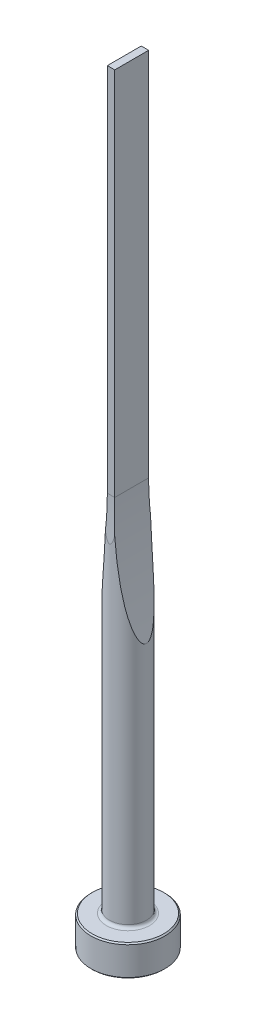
ISO-10303-21;
HEADER;
FILE_DESCRIPTION(('STEP AP214'),'2;1');
FILE_NAME('part.step','',(''),(''),'','','');
FILE_SCHEMA(('AUTOMOTIVE_DESIGN { 1 0 10303 214 1 1 1 1 }'));
ENDSEC;
DATA;
#1=APPLICATION_CONTEXT('core data for automotive mechanical design processes');
#2=APPLICATION_PROTOCOL_DEFINITION('international standard','automotive_design',2000,#1);
#3=PRODUCT_CONTEXT('',#1,'mechanical');
#4=PRODUCT('Part','Part','',(#3));
#5=PRODUCT_RELATED_PRODUCT_CATEGORY('part','',(#4));
#6=PRODUCT_DEFINITION_FORMATION('','',#4);
#7=PRODUCT_DEFINITION_CONTEXT('part definition',#1,'design');
#8=PRODUCT_DEFINITION('design','',#6,#7);
#9=PRODUCT_DEFINITION_SHAPE('','',#8);
#10=(LENGTH_UNIT() NAMED_UNIT(*) SI_UNIT(.MILLI.,.METRE.));
#11=(NAMED_UNIT(*) PLANE_ANGLE_UNIT() SI_UNIT($,.RADIAN.));
#12=(NAMED_UNIT(*) SI_UNIT($,.STERADIAN.) SOLID_ANGLE_UNIT());
#13=UNCERTAINTY_MEASURE_WITH_UNIT(LENGTH_MEASURE(1.E-05),#10,'distance_accuracy_value','');
#14=(GEOMETRIC_REPRESENTATION_CONTEXT(3) GLOBAL_UNCERTAINTY_ASSIGNED_CONTEXT((#13)) GLOBAL_UNIT_ASSIGNED_CONTEXT((#10,
#11,#12)) REPRESENTATION_CONTEXT('',''));
#15=CARTESIAN_POINT('',(0.,0.,0.));
#16=DIRECTION('',(0.,0.,1.));
#17=DIRECTION('',(1.,0.,0.));
#18=AXIS2_PLACEMENT_3D('',#15,#16,#17);
#19=CARTESIAN_POINT('',(0.,0.,0.));
#20=DIRECTION('',(0.,1.,0.));
#21=DIRECTION('',(-1.,0.,0.));
#22=AXIS2_PLACEMENT_3D('',#19,#20,#21);
#23=PLANE('',#22);
#24=CARTESIAN_POINT('',(0.,0.,0.));
#25=DIRECTION('',(0.,1.,0.));
#26=DIRECTION('',(-1.,0.,0.));
#27=AXIS2_PLACEMENT_3D('',#24,#25,#26);
#28=CIRCLE('',#27,5.8);
#29=CARTESIAN_POINT('',(-5.8,0.,0.));
#30=VERTEX_POINT('',#29);
#31=EDGE_CURVE('E133',#30,#30,#28,.T.);
#32=ORIENTED_EDGE('',*,*,#31,.F.);
#33=EDGE_LOOP('',(#32));
#34=FACE_BOUND('',#33,.T.);
#35=ADVANCED_FACE('F32',(#34),#23,.F.);
#36=CARTESIAN_POINT('',(0.,0.,0.));
#37=DIRECTION('',(0.,1.,0.));
#38=DIRECTION('',(-1.,0.,0.));
#39=AXIS2_PLACEMENT_3D('',#36,#37,#38);
#40=CONICAL_SURFACE('',#39,5.8,0.785398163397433);
#41=CARTESIAN_POINT('',(0.,0.200000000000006,0.));
#42=DIRECTION('',(0.,1.,0.));
#43=DIRECTION('',(-1.,0.,0.));
#44=AXIS2_PLACEMENT_3D('',#41,#42,#43);
#45=CIRCLE('',#44,6.);
#46=CARTESIAN_POINT('',(-6.,0.200000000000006,0.));
#47=VERTEX_POINT('',#46);
#48=EDGE_CURVE('E130',#47,#47,#45,.T.);
#49=ORIENTED_EDGE('',*,*,#48,.F.);
#50=EDGE_LOOP('',(#49));
#51=FACE_BOUND('',#50,.T.);
#52=ORIENTED_EDGE('',*,*,#31,.T.);
#53=EDGE_LOOP('',(#52));
#54=FACE_BOUND('',#53,.T.);
#55=ADVANCED_FACE('F171',(#51,#54),#40,.T.);
#56=CARTESIAN_POINT('',(0.,125.,0.));
#57=DIRECTION('',(0.,1.,0.));
#58=DIRECTION('',(-1.,0.,0.));
#59=AXIS2_PLACEMENT_3D('',#56,#57,#58);
#60=CYLINDRICAL_SURFACE('',#59,6.);
#61=CARTESIAN_POINT('',(0.,4.8,0.));
#62=DIRECTION('',(0.,1.,0.));
#63=DIRECTION('',(-1.,0.,0.));
#64=AXIS2_PLACEMENT_3D('',#61,#62,#63);
#65=CIRCLE('',#64,6.);
#66=CARTESIAN_POINT('',(-6.,4.8,0.));
#67=VERTEX_POINT('',#66);
#68=EDGE_CURVE('E127',#67,#67,#65,.T.);
#69=ORIENTED_EDGE('',*,*,#68,.F.);
#70=EDGE_LOOP('',(#69));
#71=FACE_BOUND('',#70,.T.);
#72=ORIENTED_EDGE('',*,*,#48,.T.);
#73=EDGE_LOOP('',(#72));
#74=FACE_BOUND('',#73,.T.);
#75=ADVANCED_FACE('F176',(#71,#74),#60,.T.);
#76=CARTESIAN_POINT('',(0.,4.8,0.));
#77=DIRECTION('',(0.,-1.,0.));
#78=DIRECTION('',(1.,0.,0.));
#79=AXIS2_PLACEMENT_3D('',#76,#77,#78);
#80=CONICAL_SURFACE('',#79,6.,0.785398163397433);
#81=CARTESIAN_POINT('',(0.,5.,0.));
#82=DIRECTION('',(0.,1.,0.));
#83=DIRECTION('',(-1.,0.,0.));
#84=AXIS2_PLACEMENT_3D('',#81,#82,#83);
#85=CIRCLE('',#84,5.8);
#86=CARTESIAN_POINT('',(-5.8,5.,0.));
#87=VERTEX_POINT('',#86);
#88=EDGE_CURVE('E124',#87,#87,#85,.T.);
#89=ORIENTED_EDGE('',*,*,#88,.F.);
#90=EDGE_LOOP('',(#89));
#91=FACE_BOUND('',#90,.T.);
#92=ORIENTED_EDGE('',*,*,#68,.T.);
#93=EDGE_LOOP('',(#92));
#94=FACE_BOUND('',#93,.T.);
#95=ADVANCED_FACE('F183',(#91,#94),#80,.T.);
#96=CARTESIAN_POINT('',(5.8,5.,0.));
#97=DIRECTION('',(0.,-1.,0.));
#98=DIRECTION('',(1.,0.,0.));
#99=AXIS2_PLACEMENT_3D('',#96,#97,#98);
#100=PLANE('',#99);
#101=CARTESIAN_POINT('',(0.,5.,0.));
#102=DIRECTION('',(0.,1.,0.));
#103=DIRECTION('',(-1.,0.,0.));
#104=AXIS2_PLACEMENT_3D('',#101,#102,#103);
#105=CIRCLE('',#104,3.50000000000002);
#106=CARTESIAN_POINT('',(-3.50000000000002,5.,0.));
#107=VERTEX_POINT('',#106);
#108=EDGE_CURVE('E121',#107,#107,#105,.T.);
#109=ORIENTED_EDGE('',*,*,#108,.F.);
#110=EDGE_LOOP('',(#109));
#111=FACE_BOUND('',#110,.T.);
#112=ORIENTED_EDGE('',*,*,#88,.T.);
#113=EDGE_LOOP('',(#112));
#114=FACE_BOUND('',#113,.T.);
#115=ADVANCED_FACE('F190',(#111,#114),#100,.F.);
#116=CARTESIAN_POINT('',(0.,5.5,0.));
#117=DIRECTION('',(0.,1.,0.));
#118=DIRECTION('',(-1.,0.,0.));
#119=AXIS2_PLACEMENT_3D('',#116,#117,#118);
#120=TOROIDAL_SURFACE('',#119,3.50000000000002,0.5);
#121=CARTESIAN_POINT('',(0.,5.50000000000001,0.));
#122=DIRECTION('',(0.,1.,0.));
#123=DIRECTION('',(-1.,0.,0.));
#124=AXIS2_PLACEMENT_3D('',#121,#122,#123);
#125=CIRCLE('',#124,3.00000000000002);
#126=CARTESIAN_POINT('',(-3.00000000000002,5.50000000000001,0.));
#127=VERTEX_POINT('',#126);
#128=EDGE_CURVE('E112',#127,#127,#125,.T.);
#129=ORIENTED_EDGE('',*,*,#128,.F.);
#130=EDGE_LOOP('',(#129));
#131=FACE_BOUND('',#130,.T.);
#132=ORIENTED_EDGE('',*,*,#108,.T.);
#133=EDGE_LOOP('',(#132));
#134=FACE_BOUND('',#133,.T.);
#135=ADVANCED_FACE('F168',(#131,#134),#120,.F.);
#136=CARTESIAN_POINT('',(0.,125.,0.));
#137=DIRECTION('',(0.,1.,0.));
#138=DIRECTION('',(-1.,0.,0.));
#139=AXIS2_PLACEMENT_3D('',#136,#137,#138);
#140=CYLINDRICAL_SURFACE('',#139,3.00000000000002);
#141=CARTESIAN_POINT('',(3.00000000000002,44.3544193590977,0.));
#142=CARTESIAN_POINT('',(2.99999954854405,44.3544212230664,0.048352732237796));
#143=CARTESIAN_POINT('',(2.99881313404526,44.3594533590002,0.0967104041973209));
#144=CARTESIAN_POINT('',(2.99426254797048,44.3787765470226,0.191463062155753));
#145=CARTESIAN_POINT('',(2.99089325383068,44.393089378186,0.237853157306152));
#146=CARTESIAN_POINT('',(2.98152916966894,44.4329374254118,0.336831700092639));
#147=CARTESIAN_POINT('',(2.975130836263,44.4602014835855,0.388667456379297));
#148=CARTESIAN_POINT('',(2.96059089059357,44.5223295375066,0.487236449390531));
#149=CARTESIAN_POINT('',(2.95244592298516,44.5572081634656,0.533959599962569));
#150=CARTESIAN_POINT('',(2.9359154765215,44.6282186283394,0.61809210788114));
#151=CARTESIAN_POINT('',(2.92764370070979,44.6638402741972,0.65596461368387));
#152=CARTESIAN_POINT('',(2.91044814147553,44.7381158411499,0.728478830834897));
#153=CARTESIAN_POINT('',(2.901523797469,44.7767723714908,0.76311770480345));
#154=CARTESIAN_POINT('',(2.88320082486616,44.8563951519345,0.8296663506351));
#155=CARTESIAN_POINT('',(2.87380114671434,44.8973665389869,0.86156962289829));
#156=CARTESIAN_POINT('',(2.85468203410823,44.9809836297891,0.922941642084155));
#157=CARTESIAN_POINT('',(2.84496271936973,45.0236287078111,0.9524112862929));
#158=CARTESIAN_POINT('',(2.81968911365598,45.1349082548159,1.02547116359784));
#159=CARTESIAN_POINT('',(2.80396615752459,45.2045035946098,1.06753742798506));
#160=CARTESIAN_POINT('',(2.77218749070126,45.3459768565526,1.14752701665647));
#161=CARTESIAN_POINT('',(2.75613160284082,45.417856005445,1.18544806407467));
#162=CARTESIAN_POINT('',(2.70764400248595,45.6362205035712,1.29422675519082));
#163=CARTESIAN_POINT('',(2.67494581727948,45.7851979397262,1.35995424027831));
#164=CARTESIAN_POINT('',(2.60936263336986,46.0877844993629,1.48189091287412));
#165=CARTESIAN_POINT('',(2.57647755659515,46.2414138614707,1.53804822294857));
#166=CARTESIAN_POINT('',(2.52739820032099,46.4737193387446,1.61653965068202));
#167=CARTESIAN_POINT('',(2.51108896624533,46.5514201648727,1.64173338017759));
#168=CARTESIAN_POINT('',(2.47857216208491,46.7073703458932,1.69042535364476));
#169=CARTESIAN_POINT('',(2.46236458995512,46.7856196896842,1.71392363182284));
#170=CARTESIAN_POINT('',(2.41279480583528,47.0265657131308,1.78375004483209));
#171=CARTESIAN_POINT('',(2.37963510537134,47.1900242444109,1.82759992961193));
#172=CARTESIAN_POINT('',(2.31397739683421,47.5184020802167,1.91004661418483));
#173=CARTESIAN_POINT('',(2.28147949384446,47.6833216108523,1.94864258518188));
#174=CARTESIAN_POINT('',(2.21721762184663,48.0143525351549,2.02146122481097));
#175=CARTESIAN_POINT('',(2.18545403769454,48.1804644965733,2.05568164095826));
#176=CARTESIAN_POINT('',(2.12273524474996,48.5135705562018,2.12038170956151));
#177=CARTESIAN_POINT('',(2.09178008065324,48.6805647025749,2.15086115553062));
#178=CARTESIAN_POINT('',(2.00004880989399,49.1833980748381,2.23761866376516));
#179=CARTESIAN_POINT('',(1.94055790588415,49.5203110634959,2.28905054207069));
#180=CARTESIAN_POINT('',(1.82523631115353,50.1959867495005,2.38200864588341));
#181=CARTESIAN_POINT('',(1.76940460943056,50.5347489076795,2.42353761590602));
#182=CARTESIAN_POINT('',(1.66141797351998,51.2142411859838,2.49880495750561));
#183=CARTESIAN_POINT('',(1.60926869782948,51.5549735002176,2.53253151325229));
#184=CARTESIAN_POINT('',(1.50881206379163,52.2375840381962,2.59363395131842));
#185=CARTESIAN_POINT('',(1.46050493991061,52.5794623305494,2.62100944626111));
#186=CARTESIAN_POINT('',(1.36784640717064,53.2636554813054,2.67053368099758));
#187=CARTESIAN_POINT('',(1.32348974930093,53.6059691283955,2.69268942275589));
#188=CARTESIAN_POINT('',(1.23869133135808,54.2913239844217,2.73273481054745));
#189=CARTESIAN_POINT('',(1.19824954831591,54.6343651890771,2.75062448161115));
#190=CARTESIAN_POINT('',(1.11258358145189,55.3988597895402,2.78653554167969));
#191=CARTESIAN_POINT('',(1.06835244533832,55.8204661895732,2.80366809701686));
#192=CARTESIAN_POINT('',(0.985839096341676,56.6644171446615,2.83373353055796));
#193=CARTESIAN_POINT('',(0.947557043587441,57.0867617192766,2.8466662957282));
#194=CARTESIAN_POINT('',(0.876957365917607,57.9320778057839,2.86920171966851));
#195=CARTESIAN_POINT('',(0.844640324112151,58.3550493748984,2.8788040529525));
#196=CARTESIAN_POINT('',(0.785986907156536,59.2014638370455,2.89536730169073));
#197=CARTESIAN_POINT('',(0.759650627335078,59.6249067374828,2.90232817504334));
#198=CARTESIAN_POINT('',(0.712944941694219,60.4725634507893,2.91415377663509));
#199=CARTESIAN_POINT('',(0.69258135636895,60.8967776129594,2.91901646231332));
#200=CARTESIAN_POINT('',(0.65786074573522,61.7454697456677,2.92703401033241));
#201=CARTESIAN_POINT('',(0.643503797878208,62.1699477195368,2.93018885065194));
#202=CARTESIAN_POINT('',(0.609450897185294,63.4435761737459,2.93754507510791));
#203=CARTESIAN_POINT('',(0.598768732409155,64.2929965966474,2.93963909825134));
#204=CARTESIAN_POINT('',(0.601453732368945,65.9900060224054,2.93909086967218));
#205=CARTESIAN_POINT('',(0.614770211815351,66.8375951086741,2.9364585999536));
#206=CARTESIAN_POINT('',(0.652696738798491,68.1084208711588,2.92816045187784));
#207=CARTESIAN_POINT('',(0.668332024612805,68.5319561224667,2.92466918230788));
#208=CARTESIAN_POINT('',(0.705583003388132,69.3787431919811,2.91590934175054));
#209=CARTESIAN_POINT('',(0.727198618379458,69.8019950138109,2.91064079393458));
#210=CARTESIAN_POINT('',(0.77638684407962,70.6478184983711,2.8979072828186));
#211=CARTESIAN_POINT('',(0.803955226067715,71.0703904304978,2.89044387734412));
#212=CARTESIAN_POINT('',(0.865048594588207,71.9150402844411,2.87275195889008));
#213=CARTESIAN_POINT('',(0.898573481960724,72.3371182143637,2.86252349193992));
#214=CARTESIAN_POINT('',(0.971563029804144,73.1806155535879,2.83858073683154));
#215=CARTESIAN_POINT('',(1.01102703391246,73.6020350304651,2.82486683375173));
#216=CARTESIAN_POINT('',(1.09587742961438,74.4441039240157,2.79304679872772));
#217=CARTESIAN_POINT('',(1.14126363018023,74.8647533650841,2.77494080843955));
#218=CARTESIAN_POINT('',(1.2166291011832,75.519932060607,2.74238522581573));
#219=CARTESIAN_POINT('',(1.2445838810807,75.7547906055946,2.72984052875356));
#220=CARTESIAN_POINT('',(1.30232901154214,76.2241644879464,2.7027679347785));
#221=CARTESIAN_POINT('',(1.33211934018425,76.4586798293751,2.68824006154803));
#222=CARTESIAN_POINT('',(1.42423718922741,77.1616917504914,2.64127299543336));
#223=CARTESIAN_POINT('',(1.48930683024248,77.6296130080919,2.60545231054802));
#224=CARTESIAN_POINT('',(1.62662281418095,78.563208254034,2.52202098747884));
#225=CARTESIAN_POINT('',(1.69886646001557,79.0288830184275,2.47441477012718));
#226=CARTESIAN_POINT('',(1.81245656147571,79.7250614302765,2.39106255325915));
#227=CARTESIAN_POINT('',(1.85118686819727,79.9567105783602,2.36129131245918));
#228=CARTESIAN_POINT('',(1.93034560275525,80.4190590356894,2.29703587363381));
#229=CARTESIAN_POINT('',(1.97077394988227,80.6497583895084,2.26255189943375));
#230=CARTESIAN_POINT('',(2.05334025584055,81.1103658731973,2.18789806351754));
#231=CARTESIAN_POINT('',(2.09548110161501,81.3402718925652,2.14771828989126));
#232=CARTESIAN_POINT('',(2.18131971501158,81.7985511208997,2.06048498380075));
#233=CARTESIAN_POINT('',(2.22501779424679,82.026924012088,2.01343006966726));
#234=CARTESIAN_POINT('',(2.31379210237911,82.4813925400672,1.91075197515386));
#235=CARTESIAN_POINT('',(2.35886782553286,82.7074889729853,1.85513190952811));
#236=CARTESIAN_POINT('',(2.45014233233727,83.1564023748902,1.73282311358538));
#237=CARTESIAN_POINT('',(2.4963405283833,83.3792209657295,1.6661400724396));
#238=CARTESIAN_POINT('',(2.5661732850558,83.7098404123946,1.554561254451));
#239=CARTESIAN_POINT('',(2.58957692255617,83.8196133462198,1.5153726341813));
#240=CARTESIAN_POINT('',(2.63643492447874,84.0374268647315,1.43230444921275));
#241=CARTESIAN_POINT('',(2.65988930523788,84.1454667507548,1.3884230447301));
#242=CARTESIAN_POINT('',(2.70669126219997,84.3591902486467,1.29482368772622));
#243=CARTESIAN_POINT('',(2.73003870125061,84.4648712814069,1.24509968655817));
#244=CARTESIAN_POINT('',(2.77627728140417,84.6724433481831,1.13827697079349));
#245=CARTESIAN_POINT('',(2.79916883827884,84.7743379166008,1.08118536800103));
#246=CARTESIAN_POINT('',(2.84421494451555,84.9732972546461,0.95651447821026));
#247=CARTESIAN_POINT('',(2.86636091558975,85.0703097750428,0.888844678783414));
#248=CARTESIAN_POINT('',(2.8978839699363,85.2074506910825,0.77700352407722));
#249=CARTESIAN_POINT('',(2.90808585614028,85.2516689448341,0.738109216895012));
#250=CARTESIAN_POINT('',(2.92766210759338,85.3362493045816,0.656181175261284));
#251=CARTESIAN_POINT('',(2.93703767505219,85.3766170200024,0.613153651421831));
#252=CARTESIAN_POINT('',(2.95286393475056,85.4445717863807,0.531023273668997));
#253=CARTESIAN_POINT('',(2.9595297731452,85.4731213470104,0.492767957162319));
#254=CARTESIAN_POINT('',(2.97174032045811,85.5253215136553,0.412789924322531));
#255=CARTESIAN_POINT('',(2.97728453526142,85.5489699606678,0.37106569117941));
#256=CARTESIAN_POINT('',(2.98688558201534,85.5898672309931,0.283667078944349));
#257=CARTESIAN_POINT('',(2.99092210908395,85.6070287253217,0.23794834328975));
#258=CARTESIAN_POINT('',(2.99690909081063,85.6324657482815,0.143990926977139));
#259=CARTESIAN_POINT('',(2.99886455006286,85.640762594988,0.0957585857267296));
#260=CARTESIAN_POINT('',(3.00031309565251,85.64690925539,0.00370587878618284));
#261=CARTESIAN_POINT('',(3.00004412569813,85.6457685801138,-0.0400433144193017));
#262=CARTESIAN_POINT('',(2.99764218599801,85.6355744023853,-0.126566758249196));
#263=CARTESIAN_POINT('',(2.99550742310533,85.626513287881,-0.169340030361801));
#264=CARTESIAN_POINT('',(2.98914571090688,85.5994763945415,-0.259584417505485));
#265=CARTESIAN_POINT('',(2.98463061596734,85.5802718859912,-0.306658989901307));
#266=CARTESIAN_POINT('',(2.97396142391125,85.5347975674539,-0.397031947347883));
#267=CARTESIAN_POINT('',(2.96780425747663,85.5085145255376,-0.440323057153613));
#268=CARTESIAN_POINT('',(2.94983205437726,85.4316044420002,-0.550830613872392));
#269=CARTESIAN_POINT('',(2.93698705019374,85.3764521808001,-0.614685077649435));
#270=CARTESIAN_POINT('',(2.90952748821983,85.2579561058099,-0.73374651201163));
#271=CARTESIAN_POINT('',(2.89490771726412,85.1945881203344,-0.788926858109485));
#272=CARTESIAN_POINT('',(2.85840241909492,85.035497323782,-0.913992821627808));
#273=CARTESIAN_POINT('',(2.8360182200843,84.9372555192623,-0.980485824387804));
#274=CARTESIAN_POINT('',(2.79031862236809,84.7350119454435,-1.10382067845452));
#275=CARTESIAN_POINT('',(2.76700129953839,84.6309980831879,-1.16064116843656));
#276=CARTESIAN_POINT('',(2.71985245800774,84.4188449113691,-1.26720476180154));
#277=CARTESIAN_POINT('',(2.69601887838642,84.3106867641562,-1.31690902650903));
#278=CARTESIAN_POINT('',(2.6482752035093,84.0920565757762,-1.41045614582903));
#279=CARTESIAN_POINT('',(2.62436521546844,83.9815870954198,-1.45430512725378));
#280=CARTESIAN_POINT('',(2.57821293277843,83.7663606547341,-1.53453935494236));
#281=CARTESIAN_POINT('',(2.55596620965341,83.6617167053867,-1.57122780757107));
#282=CARTESIAN_POINT('',(2.51161973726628,83.451255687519,-1.64118136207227));
#283=CARTESIAN_POINT('',(2.48952000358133,83.3454384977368,-1.67444610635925));
#284=CARTESIAN_POINT('',(2.42351886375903,83.0265162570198,-1.76990864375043));
#285=CARTESIAN_POINT('',(2.37993617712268,82.8120367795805,-1.82774006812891));
#286=CARTESIAN_POINT('',(2.29385170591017,82.3802412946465,-1.93466697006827));
#287=CARTESIAN_POINT('',(2.25135244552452,82.1629201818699,-1.98374340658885));
#288=CARTESIAN_POINT('',(2.16769555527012,81.7265326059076,-2.07482958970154));
#289=CARTESIAN_POINT('',(2.12653806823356,81.5074659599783,-2.11683858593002));
#290=CARTESIAN_POINT('',(2.0456003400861,81.0676199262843,-2.19515180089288));
#291=CARTESIAN_POINT('',(2.00582293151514,80.846838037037,-2.23144477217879));
#292=CARTESIAN_POINT('',(1.92779808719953,80.4042560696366,-2.29918715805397));
#293=CARTESIAN_POINT('',(1.88955073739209,80.1824559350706,-2.33063630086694));
#294=CARTESIAN_POINT('',(1.81468937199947,79.738359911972,-2.38938543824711));
#295=CARTESIAN_POINT('',(1.77807314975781,79.5160651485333,-2.41669116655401));
#296=CARTESIAN_POINT('',(1.70645210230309,79.0708205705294,-2.46778257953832));
#297=CARTESIAN_POINT('',(1.6714472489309,78.8478707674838,-2.49156832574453));
#298=CARTESIAN_POINT('',(1.56911137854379,78.1796617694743,-2.55822914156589));
#299=CARTESIAN_POINT('',(1.50421176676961,77.7335764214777,-2.596594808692));
#300=CARTESIAN_POINT('',(1.38103837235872,76.8397827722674,-2.66414008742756));
#301=CARTESIAN_POINT('',(1.32276521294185,76.3920743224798,-2.69331883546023));
#302=CARTESIAN_POINT('',(1.2129037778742,75.4952924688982,-2.7445468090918));
#303=CARTESIAN_POINT('',(1.1613176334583,75.0462186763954,-2.76659376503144));
#304=CARTESIAN_POINT('',(1.06489586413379,74.1471068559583,-2.80511813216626));
#305=CARTESIAN_POINT('',(1.02006035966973,73.697068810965,-2.82159544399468));
#306=CARTESIAN_POINT('',(0.937096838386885,72.795453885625,-2.85022399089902));
#307=CARTESIAN_POINT('',(0.898980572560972,72.3438756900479,-2.8623676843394));
#308=CARTESIAN_POINT('',(0.829568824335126,71.4401156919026,-2.88324951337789));
#309=CARTESIAN_POINT('',(0.798273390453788,70.9879338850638,-2.89198762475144));
#310=CARTESIAN_POINT('',(0.742520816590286,70.0831895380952,-2.90680131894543));
#311=CARTESIAN_POINT('',(0.71806242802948,69.6306270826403,-2.91287738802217));
#312=CARTESIAN_POINT('',(0.675984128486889,68.7251557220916,-2.9229288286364));
#313=CARTESIAN_POINT('',(0.658364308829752,68.2722468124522,-2.92690417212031));
#314=CARTESIAN_POINT('',(0.629994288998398,67.3670163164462,-2.93314123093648));
#315=CARTESIAN_POINT('',(0.619231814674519,66.9146951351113,-2.93540600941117));
#316=CARTESIAN_POINT('',(0.604529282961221,66.0099297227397,-2.93846909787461));
#317=CARTESIAN_POINT('',(0.600589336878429,65.5574854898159,-2.93926738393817));
#318=CARTESIAN_POINT('',(0.599533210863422,64.6525553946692,-2.93948298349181));
#319=CARTESIAN_POINT('',(0.602417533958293,64.200069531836,-2.93890019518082));
#320=CARTESIAN_POINT('',(0.615010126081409,63.2952041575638,-2.93629085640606));
#321=CARTESIAN_POINT('',(0.624718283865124,62.8428246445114,-2.93426432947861));
#322=CARTESIAN_POINT('',(0.650943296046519,61.9387039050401,-2.92855815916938));
#323=CARTESIAN_POINT('',(0.667453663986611,61.4869624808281,-2.92488009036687));
#324=CARTESIAN_POINT('',(0.707277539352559,60.5838066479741,-2.91550637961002));
#325=CARTESIAN_POINT('',(0.730590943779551,60.1323922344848,-2.90981076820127));
#326=CARTESIAN_POINT('',(0.784010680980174,59.2300511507,-2.89587454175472));
#327=CARTESIAN_POINT('',(0.814116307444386,58.7791244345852,-2.88763419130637));
#328=CARTESIAN_POINT('',(0.88111005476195,57.8778533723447,-2.86790293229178));
#329=CARTESIAN_POINT('',(0.917998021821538,57.4275090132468,-2.85641209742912));
#330=CARTESIAN_POINT('',(0.989843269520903,56.6247218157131,-2.83219298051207));
#331=CARTESIAN_POINT('',(1.02349736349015,56.2721377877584,-2.82026773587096));
#332=CARTESIAN_POINT('',(1.09495320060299,55.5675028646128,-2.79330218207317));
#333=CARTESIAN_POINT('',(1.13275499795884,55.2154519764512,-2.77826183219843));
#334=CARTESIAN_POINT('',(1.21247129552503,54.5121549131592,-2.74441085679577));
#335=CARTESIAN_POINT('',(1.25438393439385,54.1609084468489,-2.72560193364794));
#336=CARTESIAN_POINT('',(1.34230956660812,53.4592142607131,-2.68338899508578));
#337=CARTESIAN_POINT('',(1.38832247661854,53.1087665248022,-2.65998507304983));
#338=CARTESIAN_POINT('',(1.50174960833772,52.2825803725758,-2.5981418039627));
#339=CARTESIAN_POINT('',(1.57089655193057,51.8072470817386,-2.55732417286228));
#340=CARTESIAN_POINT('',(1.68014772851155,51.0961366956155,-2.48575504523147));
#341=CARTESIAN_POINT('',(1.71748757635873,50.8594089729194,-2.4601741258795));
#342=CARTESIAN_POINT('',(1.79397886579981,50.386720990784,-2.4049675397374));
#343=CARTESIAN_POINT('',(1.83313026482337,50.1507607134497,-2.37534196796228));
#344=CARTESIAN_POINT('',(1.92804621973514,49.5924756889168,-2.29947574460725));
#345=CARTESIAN_POINT('',(1.98458899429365,49.2705620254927,-2.25114704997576));
#346=CARTESIAN_POINT('',(2.10083962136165,48.6291482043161,-2.14308474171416));
#347=CARTESIAN_POINT('',(2.16054773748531,48.3096482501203,-2.08335017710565));
#348=CARTESIAN_POINT('',(2.26396974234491,47.7722346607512,-1.96935933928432));
#349=CARTESIAN_POINT('',(2.30694621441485,47.5533391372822,-1.91908164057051));
#350=CARTESIAN_POINT('',(2.3940416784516,47.1182201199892,-1.80928432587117));
#351=CARTESIAN_POINT('',(2.43815985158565,46.9019948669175,-1.74977118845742));
#352=CARTESIAN_POINT('',(2.51383172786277,46.5378652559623,-1.63820252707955));
#353=CARTESIAN_POINT('',(2.54517613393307,46.388960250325,-1.58928214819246));
#354=CARTESIAN_POINT('',(2.60812136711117,46.0935966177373,-1.48374973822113));
#355=CARTESIAN_POINT('',(2.63972253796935,45.9471425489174,-1.42712485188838));
#356=CARTESIAN_POINT('',(2.68802167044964,45.7259168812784,-1.33262383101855));
#357=CARTESIAN_POINT('',(2.70478476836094,45.6496220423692,-1.29834782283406));
#358=CARTESIAN_POINT('',(2.73816263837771,45.4986281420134,-1.22639444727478));
#359=CARTESIAN_POINT('',(2.75477744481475,45.4239287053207,-1.18871789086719));
#360=CARTESIAN_POINT('',(2.78767783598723,45.2768730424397,-1.10936597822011));
#361=CARTESIAN_POINT('',(2.80396421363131,45.2045108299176,-1.06770213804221));
#362=CARTESIAN_POINT('',(2.83603012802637,45.062827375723,-0.979360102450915));
#363=CARTESIAN_POINT('',(2.85181006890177,44.9935036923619,-0.932686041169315));
#364=CARTESIAN_POINT('',(2.87943742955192,44.8727563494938,-0.842958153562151));
#365=CARTESIAN_POINT('',(2.89143999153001,44.8205263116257,-0.801048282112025));
#366=CARTESIAN_POINT('',(2.91460908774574,44.7200868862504,-0.712158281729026));
#367=CARTESIAN_POINT('',(2.92577385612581,44.6718859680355,-0.665167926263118));
#368=CARTESIAN_POINT('',(2.94687801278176,44.5810773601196,-0.564450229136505));
#369=CARTESIAN_POINT('',(2.9567981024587,44.5385572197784,-0.510637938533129));
#370=CARTESIAN_POINT('',(2.97430949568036,44.4636945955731,-0.395983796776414));
#371=CARTESIAN_POINT('',(2.98191077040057,44.4313085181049,-0.335173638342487));
#372=CARTESIAN_POINT('',(2.99163165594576,44.3899515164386,-0.22806078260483));
#373=CARTESIAN_POINT('',(2.99473052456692,44.376788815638,-0.183494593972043));
#374=CARTESIAN_POINT('',(2.99891293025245,44.3590302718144,-0.09261803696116));
#375=CARTESIAN_POINT('',(3.00000043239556,44.3544175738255,-0.0463112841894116));
#376=CARTESIAN_POINT('',(3.00000000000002,44.3544193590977,0.));
#377=B_SPLINE_CURVE_WITH_KNOTS('',3,(#141,#142,#143,#144,#145,#146,#147,#148,#149,#150,#151,
#152,#153,#154,#155,#156,#157,#158,#159,#160,#161,#162,#163,#164,#165,#166,#167,#168,#169,#170,
#171,#172,#173,#174,#175,#176,#177,#178,#179,#180,#181,#182,#183,#184,#185,#186,#187,#188,#189,
#190,#191,#192,#193,#194,#195,#196,#197,#198,#199,#200,#201,#202,#203,#204,#205,#206,#207,#208,
#209,#210,#211,#212,#213,#214,#215,#216,#217,#218,#219,#220,#221,#222,#223,#224,#225,#226,#227,
#228,#229,#230,#231,#232,#233,#234,#235,#236,#237,#238,#239,#240,#241,#242,#243,#244,#245,#246,
#247,#248,#249,#250,#251,#252,#253,#254,#255,#256,#257,#258,#259,#260,#261,#262,#263,#264,#265,
#266,#267,#268,#269,#270,#271,#272,#273,#274,#275,#276,#277,#278,#279,#280,#281,#282,#283,#284,
#285,#286,#287,#288,#289,#290,#291,#292,#293,#294,#295,#296,#297,#298,#299,#300,#301,#302,#303,
#304,#305,#306,#307,#308,#309,#310,#311,#312,#313,#314,#315,#316,#317,#318,#319,#320,#321,#322,
#323,#324,#325,#326,#327,#328,#329,#330,#331,#332,#333,#334,#335,#336,#337,#338,#339,#340,#341,
#342,#343,#344,#345,#346,#347,#348,#349,#350,#351,#352,#353,#354,#355,#356,#357,#358,#359,#360,
#361,#362,#363,#364,#365,#366,#367,#368,#369,#370,#371,#372,#373,#374,#375,#376),.UNSPECIFIED.,
.T.,.F.,(4,2,2,2,2,2,2,2,2,2,2,2,2,2,2,2,2,2,2,2,2,2,2,2,2,2,2,2,2,2,2,2,2,2,2,2,2,2,2,2,2,2,2,
2,2,2,2,2,2,2,2,2,2,2,2,2,2,2,2,2,2,2,2,2,2,2,2,2,2,2,2,2,2,2,2,2,2,2,2,2,2,2,2,2,2,2,2,2,2,2,2,
2,2,2,2,2,2,2,2,2,2,2,2,2,2,2,2,2,2,2,2,2,2,2,2,2,2,4),(0.,0.144818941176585,0.289978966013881,
0.465715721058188,0.641793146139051,0.799504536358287,0.957353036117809,1.11556674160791,
1.27372185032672,1.52200926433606,1.77043237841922,2.26811973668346,2.76842457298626,
3.01829386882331,3.26815812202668,3.78540458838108,4.30273255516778,4.82032577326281,
5.33794754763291,6.37561556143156,7.41299565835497,8.45193660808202,9.49094091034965,
10.5285434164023,11.5661398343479,12.8388673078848,14.1116290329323,15.3845151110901,
16.6574214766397,17.9315642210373,19.2057233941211,21.7538152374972,24.2965317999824,
25.5680080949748,26.8394678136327,28.1100272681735,29.3805655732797,30.6509635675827,
31.9213205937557,32.6318531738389,33.3423772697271,34.7635500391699,36.1841905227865,
36.8943791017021,37.6045339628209,38.315940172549,39.027489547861,39.7387807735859,
40.4497073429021,40.8062812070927,41.1629953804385,41.5200821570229,41.8768267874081,
42.2368103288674,42.4159185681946,42.5947617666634,42.7390562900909,42.8834142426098,
43.0296516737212,43.1755366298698,43.306035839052,43.4366606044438,43.5889377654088,
43.7415015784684,43.9960974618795,44.2514601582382,44.6127315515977,44.9747907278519,
45.3387562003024,45.7023377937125,46.0415653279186,46.3808282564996,47.0596667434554,
47.7399640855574,48.4203336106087,49.1020256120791,49.7837558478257,50.4645339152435,
51.1453000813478,52.5023375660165,53.8595025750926,55.2170990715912,56.5747197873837,
57.9346917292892,59.2946733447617,60.6544064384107,62.0141576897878,63.3714681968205,
64.7288008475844,66.0862335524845,67.4436441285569,68.7997632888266,70.1558619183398,
71.5118195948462,72.867746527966,73.9308736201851,74.9940146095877,76.056676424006,
77.1193166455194,78.5652732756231,79.2882874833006,80.0112847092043,81.002305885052,
81.9934097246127,82.6792779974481,83.3646672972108,83.8440461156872,84.3242348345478,
84.5800836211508,84.8358715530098,85.0909418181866,85.3458032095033,85.5496747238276,
85.7539645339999,85.961108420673,86.1673485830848,86.3063275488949,86.4450322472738),.UNSPECIFIED.);
#378=CARTESIAN_POINT('',(0.753763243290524,59.7413175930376,-2.90376324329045));
#379=VERTEX_POINT('',#378);
#380=CARTESIAN_POINT('',(0.753763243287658,59.741317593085,2.90376324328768));
#381=VERTEX_POINT('',#380);
#382=EDGE_CURVE('E138',#379,#381,#377,.T.);
#383=ORIENTED_EDGE('',*,*,#382,.T.);
#384=CARTESIAN_POINT('',(-1.19895788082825,65.,2.74999999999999));
#385=CARTESIAN_POINT('',(-1.19897952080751,65.5078240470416,2.7500005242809));
#386=CARTESIAN_POINT('',(-1.18927252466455,66.0156821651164,2.75430147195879));
#387=CARTESIAN_POINT('',(-1.15875125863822,66.7777588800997,2.76719867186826));
#388=CARTESIAN_POINT('',(-1.1458730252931,67.0323726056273,2.77259034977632));
#389=CARTESIAN_POINT('',(-1.11408427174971,67.5410752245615,2.7855202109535));
#390=CARTESIAN_POINT('',(-1.09517627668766,67.7951642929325,2.7930574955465));
#391=CARTESIAN_POINT('',(-1.05054489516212,68.2992875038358,2.81014523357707));
#392=CARTESIAN_POINT('',(-1.02491501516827,68.5493308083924,2.81966772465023));
#393=CARTESIAN_POINT('',(-0.964932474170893,69.0487156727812,2.84076574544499));
#394=CARTESIAN_POINT('',(-0.93056667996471,69.2980555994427,2.85234435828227));
#395=CARTESIAN_POINT('',(-0.870049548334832,69.6696537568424,2.87113933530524));
#396=CARTESIAN_POINT('',(-0.848472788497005,69.7926943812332,2.87761721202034));
#397=CARTESIAN_POINT('',(-0.801568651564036,70.0380271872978,2.89103629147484));
#398=CARTESIAN_POINT('',(-0.776241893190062,70.1603194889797,2.89797741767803));
#399=CARTESIAN_POINT('',(-0.720753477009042,70.4034742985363,2.91227256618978));
#400=CARTESIAN_POINT('',(-0.690603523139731,70.5243395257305,2.9196255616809));
#401=CARTESIAN_POINT('',(-0.623527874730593,70.7641294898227,2.93469409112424));
#402=CARTESIAN_POINT('',(-0.586609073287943,70.8830560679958,2.94240925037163));
#403=CARTESIAN_POINT('',(-0.53222534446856,71.0331253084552,2.95243594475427));
#404=CARTESIAN_POINT('',(-0.519782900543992,71.0660915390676,2.95465705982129));
#405=CARTESIAN_POINT('',(-0.49382440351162,71.1316010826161,2.95910656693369));
#406=CARTESIAN_POINT('',(-0.480308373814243,71.1641444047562,2.96133495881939));
#407=CARTESIAN_POINT('',(-0.437923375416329,71.2607815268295,2.96800415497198));
#408=CARTESIAN_POINT('',(-0.407160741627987,71.3240456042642,2.97243989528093));
#409=CARTESIAN_POINT('',(-0.33948043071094,71.443295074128,2.98092262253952));
#410=CARTESIAN_POINT('',(-0.302974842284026,71.4994884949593,2.98497775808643));
#411=CARTESIAN_POINT('',(-0.243249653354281,71.5706099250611,2.99016761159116));
#412=CARTESIAN_POINT('',(-0.225380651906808,71.589912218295,2.99158318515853));
#413=CARTESIAN_POINT('',(-0.187063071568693,71.6257850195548,2.99422420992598));
#414=CARTESIAN_POINT('',(-0.16662375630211,71.6423648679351,2.99545031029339));
#415=CARTESIAN_POINT('',(-0.132225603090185,71.6647469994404,2.99711026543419));
#416=CARTESIAN_POINT('',(-0.119296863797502,71.6721061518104,2.99765718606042));
#417=CARTESIAN_POINT('',(-0.0924786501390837,71.6848335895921,2.99860424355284));
#418=CARTESIAN_POINT('',(-0.0785901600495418,71.6902038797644,2.99900452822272));
#419=CARTESIAN_POINT('',(-0.0498799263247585,71.6984547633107,2.99961993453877));
#420=CARTESIAN_POINT('',(-0.0350488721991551,71.7013042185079,2.99983274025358));
#421=CARTESIAN_POINT('',(-0.00511706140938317,71.7039833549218,3.00003281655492));
#422=CARTESIAN_POINT('',(0.00998340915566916,71.7038160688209,3.00002031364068));
#423=CARTESIAN_POINT('',(0.0377473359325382,71.7007339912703,2.99979016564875));
#424=CARTESIAN_POINT('',(0.0504568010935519,71.6982058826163,2.99960139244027));
#425=CARTESIAN_POINT('',(0.0753269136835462,71.6912160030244,2.99908000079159));
#426=CARTESIAN_POINT('',(0.0874870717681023,71.6867525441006,2.99874725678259));
#427=CARTESIAN_POINT('',(0.117304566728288,71.6734908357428,2.99776000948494));
#428=CARTESIAN_POINT('',(0.13449008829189,71.6636473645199,2.99702831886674));
#429=CARTESIAN_POINT('',(0.167153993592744,71.6414692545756,2.99538445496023));
#430=CARTESIAN_POINT('',(0.182627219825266,71.6291273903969,2.99447175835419));
#431=CARTESIAN_POINT('',(0.2257180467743,71.5906116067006,2.99163284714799));
#432=CARTESIAN_POINT('',(0.2513078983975,71.5622150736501,2.98955095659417));
#433=CARTESIAN_POINT('',(0.298583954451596,71.5023955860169,2.98519748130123));
#434=CARTESIAN_POINT('',(0.320256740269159,71.4709627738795,2.98292528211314));
#435=CARTESIAN_POINT('',(0.376076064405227,71.3821026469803,2.97655204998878));
#436=CARTESIAN_POINT('',(0.407351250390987,71.3228981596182,2.97236032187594));
#437=CARTESIAN_POINT('',(0.464715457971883,71.2019914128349,2.96392635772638));
#438=CARTESIAN_POINT('',(0.490790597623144,71.1402829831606,2.95968401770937));
#439=CARTESIAN_POINT('',(0.539393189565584,71.0151533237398,2.95121450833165));
#440=CARTESIAN_POINT('',(0.561903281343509,70.9517253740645,2.9469875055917));
#441=CARTESIAN_POINT('',(0.604138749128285,70.8240591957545,2.93861747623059));
#442=CARTESIAN_POINT('',(0.623867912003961,70.7598222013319,2.93447434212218));
#443=CARTESIAN_POINT('',(0.687009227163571,70.5416029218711,2.920637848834));
#444=CARTESIAN_POINT('',(0.72550257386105,70.3861879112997,2.91118093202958));
#445=CARTESIAN_POINT('',(0.794909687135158,70.0736090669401,2.89298537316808));
#446=CARTESIAN_POINT('',(0.825818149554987,69.9164440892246,2.88424723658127));
#447=CARTESIAN_POINT('',(0.882130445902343,69.6006711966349,2.86752741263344));
#448=CARTESIAN_POINT('',(0.907519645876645,69.4420605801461,2.85954776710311));
#449=CARTESIAN_POINT('',(0.953912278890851,69.1242228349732,2.84440447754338));
#450=CARTESIAN_POINT('',(0.974917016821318,68.9649959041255,2.83724059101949));
#451=CARTESIAN_POINT('',(1.03276252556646,68.4851511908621,2.81693320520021));
#452=CARTESIAN_POINT('',(1.06419241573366,68.1638255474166,2.805051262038));
#453=CARTESIAN_POINT('',(1.11623470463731,67.5208794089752,2.78473743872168));
#454=CARTESIAN_POINT('',(1.13686835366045,67.1992607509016,2.7762987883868));
#455=CARTESIAN_POINT('',(1.16917424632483,66.554667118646,2.76284984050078));
#456=CARTESIAN_POINT('',(1.18082300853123,66.2316907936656,2.75784852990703));
#457=CARTESIAN_POINT('',(1.19594203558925,65.5855107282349,2.75132454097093));
#458=CARTESIAN_POINT('',(1.1994121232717,65.2623069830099,2.74980193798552));
#459=CARTESIAN_POINT('',(1.19840705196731,64.6145622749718,2.75024017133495));
#460=CARTESIAN_POINT('',(1.19389860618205,64.2900213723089,2.75221560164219));
#461=CARTESIAN_POINT('',(1.17656472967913,63.6413194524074,2.75967187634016));
#462=CARTESIAN_POINT('',(1.16374248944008,63.3171583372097,2.76515137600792));
#463=CARTESIAN_POINT('',(1.12903192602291,62.673678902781,2.77950240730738));
#464=CARTESIAN_POINT('',(1.10726533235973,62.3543530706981,2.78832827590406));
#465=CARTESIAN_POINT('',(1.05280621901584,61.7162712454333,2.80935794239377));
#466=CARTESIAN_POINT('',(1.02009944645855,61.3975165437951,2.82156614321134));
#467=CARTESIAN_POINT('',(0.960080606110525,60.9219501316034,2.84230016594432));
#468=CARTESIAN_POINT('',(0.938338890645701,60.7643795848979,2.84958669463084));
#469=CARTESIAN_POINT('',(0.890325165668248,60.4498925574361,2.86495508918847));
#470=CARTESIAN_POINT('',(0.864051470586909,60.2929763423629,2.87303725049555));
#471=CARTESIAN_POINT('',(0.805707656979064,59.9806378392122,2.88993979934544));
#472=CARTESIAN_POINT('',(0.773651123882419,59.8252129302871,2.89875843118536));
#473=CARTESIAN_POINT('',(0.70147322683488,59.5163138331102,2.91708269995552));
#474=CARTESIAN_POINT('',(0.66135886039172,59.3628380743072,2.92658773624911));
#475=CARTESIAN_POINT('',(0.599571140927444,59.1622791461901,2.93951368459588));
#476=CARTESIAN_POINT('',(0.583753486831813,59.1133825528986,2.94270568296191));
#477=CARTESIAN_POINT('',(0.550376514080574,59.0161514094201,2.94913181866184));
#478=CARTESIAN_POINT('',(0.53281618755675,58.9678172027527,2.95236597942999));
#479=CARTESIAN_POINT('',(0.49547428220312,58.8718768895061,2.95886221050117));
#480=CARTESIAN_POINT('',(0.475687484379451,58.8242728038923,2.96212432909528));
#481=CARTESIAN_POINT('',(0.43323012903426,58.7303798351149,2.96863184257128));
#482=CARTESIAN_POINT('',(0.410562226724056,58.6840897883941,2.97187725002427));
#483=CARTESIAN_POINT('',(0.360948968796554,58.5932525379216,2.97831355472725));
#484=CARTESIAN_POINT('',(0.33396303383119,58.5487274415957,2.981503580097));
#485=CARTESIAN_POINT('',(0.273823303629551,58.4640019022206,2.98763333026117));
#486=CARTESIAN_POINT('',(0.240714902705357,58.4237728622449,2.99057467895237));
#487=CARTESIAN_POINT('',(0.18790833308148,58.3753088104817,2.9941441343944));
#488=CARTESIAN_POINT('',(0.17244376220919,58.3625865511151,2.99508437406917));
#489=CARTESIAN_POINT('',(0.139769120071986,58.3396025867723,2.99678704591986));
#490=CARTESIAN_POINT('',(0.122564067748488,58.3293340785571,2.99754996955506));
#491=CARTESIAN_POINT('',(0.0920979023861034,58.3150686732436,2.99861155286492));
#492=CARTESIAN_POINT('',(0.0792928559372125,58.3101148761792,2.99898077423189));
#493=CARTESIAN_POINT('',(0.0530412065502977,58.3023526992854,2.99955968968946));
#494=CARTESIAN_POINT('',(0.0395953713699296,58.2995418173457,2.99976956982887));
#495=CARTESIAN_POINT('',(0.0123234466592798,58.2963783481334,3.00000579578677));
#496=CARTESIAN_POINT('',(-0.00150445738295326,58.2960408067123,3.00003101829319));
#497=CARTESIAN_POINT('',(-0.0289863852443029,58.2979088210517,2.99989150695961));
#498=CARTESIAN_POINT('',(-0.0426403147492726,58.30011570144,2.99972667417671));
#499=CARTESIAN_POINT('',(-0.0713132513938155,58.3072893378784,2.99919143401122));
#500=CARTESIAN_POINT('',(-0.0862409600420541,58.3126116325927,2.9987945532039));
#501=CARTESIAN_POINT('',(-0.115034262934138,58.3255893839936,2.99782852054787));
#502=CARTESIAN_POINT('',(-0.128897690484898,58.3332494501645,2.99725902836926));
#503=CARTESIAN_POINT('',(-0.163968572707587,58.3556775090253,2.99559526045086));
#504=CARTESIAN_POINT('',(-0.184247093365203,58.3718697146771,2.99439742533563));
#505=CARTESIAN_POINT('',(-0.222285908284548,58.4069419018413,2.99181430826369));
#506=CARTESIAN_POINT('',(-0.240038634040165,58.4258296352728,2.99042848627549));
#507=CARTESIAN_POINT('',(-0.280818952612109,58.4738008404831,2.98692562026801));
#508=CARTESIAN_POINT('',(-0.302801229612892,58.5037572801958,2.98475182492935));
#509=CARTESIAN_POINT('',(-0.343876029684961,58.56560711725,2.98029708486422));
#510=CARTESIAN_POINT('',(-0.362961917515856,58.5975047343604,2.97801590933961));
#511=CARTESIAN_POINT('',(-0.417189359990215,58.6952833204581,2.97107815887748));
#512=CARTESIAN_POINT('',(-0.449076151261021,58.762946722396,2.96634960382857));
#513=CARTESIAN_POINT('',(-0.507522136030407,58.9004515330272,2.95690285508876));
#514=CARTESIAN_POINT('',(-0.534078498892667,58.9702940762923,2.95218466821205));
#515=CARTESIAN_POINT('',(-0.58343718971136,59.1113147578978,2.94282667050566));
#516=CARTESIAN_POINT('',(-0.606238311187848,59.182493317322,2.93818688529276));
#517=CARTESIAN_POINT('',(-0.670588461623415,59.3976071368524,2.92442540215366));
#518=CARTESIAN_POINT('',(-0.707956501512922,59.542789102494,2.91548441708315));
#519=CARTESIAN_POINT('',(-0.775545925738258,59.8347309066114,2.8982252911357));
#520=CARTESIAN_POINT('',(-0.805769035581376,59.9814903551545,2.88990700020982));
#521=CARTESIAN_POINT('',(-0.860937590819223,60.2758101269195,2.87395360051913));
#522=CARTESIAN_POINT('',(-0.885890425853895,60.4233690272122,2.86631754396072));
#523=CARTESIAN_POINT('',(-0.937056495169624,60.7534864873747,2.8500533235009));
#524=CARTESIAN_POINT('',(-0.962216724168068,60.9362151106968,2.8416065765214));
#525=CARTESIAN_POINT('',(-1.00766798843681,61.3023321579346,2.82580502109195));
#526=CARTESIAN_POINT('',(-1.02795847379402,61.485720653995,2.81845033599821));
#527=CARTESIAN_POINT('',(-1.08284239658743,62.036928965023,2.79803797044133));
#528=CARTESIAN_POINT('',(-1.11139411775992,62.4054154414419,2.78665055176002));
#529=CARTESIAN_POINT('',(-1.15618392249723,63.1449701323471,2.76835525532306));
#530=CARTESIAN_POINT('',(-1.1723624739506,63.5160422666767,2.76146905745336));
#531=CARTESIAN_POINT('',(-1.19373453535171,64.2580705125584,2.75229417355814));
#532=CARTESIAN_POINT('',(-1.19894207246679,64.6290261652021,2.74999961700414));
#533=CARTESIAN_POINT('',(-1.19895788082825,65.,2.74999999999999));
#534=B_SPLINE_CURVE_WITH_KNOTS('',3,(#384,#385,#386,#387,#388,#389,#390,#391,#392,#393,#394,
#395,#396,#397,#398,#399,#400,#401,#402,#403,#404,#405,#406,#407,#408,#409,#410,#411,#412,#413,
#414,#415,#416,#417,#418,#419,#420,#421,#422,#423,#424,#425,#426,#427,#428,#429,#430,#431,#432,
#433,#434,#435,#436,#437,#438,#439,#440,#441,#442,#443,#444,#445,#446,#447,#448,#449,#450,#451,
#452,#453,#454,#455,#456,#457,#458,#459,#460,#461,#462,#463,#464,#465,#466,#467,#468,#469,#470,
#471,#472,#473,#474,#475,#476,#477,#478,#479,#480,#481,#482,#483,#484,#485,#486,#487,#488,#489,
#490,#491,#492,#493,#494,#495,#496,#497,#498,#499,#500,#501,#502,#503,#504,#505,#506,#507,#508,
#509,#510,#511,#512,#513,#514,#515,#516,#517,#518,#519,#520,#521,#522,#523,#524,#525,#526,#527,
#528,#529,#530,#531,#532,#533),.UNSPECIFIED.,.T.,.F.,(4,2,2,2,2,2,2,2,2,2,2,2,2,2,2,2,2,2,2,2,2,
2,2,2,2,2,2,2,2,2,2,2,2,2,2,2,2,2,2,2,2,2,2,2,2,2,2,2,2,2,2,2,2,2,2,2,2,2,2,2,2,2,2,2,2,2,2,2,2,
2,2,2,2,2,4),(0.,1.52336196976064,2.28829204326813,3.05290220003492,3.80739350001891,
4.56302584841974,4.93824292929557,5.31339817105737,5.68765649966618,6.06153579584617,
6.16744011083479,6.27334211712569,6.48462856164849,6.68472896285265,6.76359605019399,
6.84218663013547,6.88671949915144,6.93120735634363,6.97623736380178,7.0212221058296,
7.05992905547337,7.09866983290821,7.15778245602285,7.2170685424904,7.33127335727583,
7.44586227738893,7.64659681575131,7.84786026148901,8.05007550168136,8.25201266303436,
8.73281405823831,9.21395072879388,9.69634794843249,10.1786013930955,11.147537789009,
12.1145597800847,13.0841005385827,14.0536622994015,15.0272786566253,16.0005216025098,
16.9609360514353,17.9226066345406,18.4002500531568,18.8780715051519,19.3547847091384,
19.8310857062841,19.9855333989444,20.1400709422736,20.2949785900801,20.4497444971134,
20.6060609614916,20.7612618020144,20.8212505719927,20.8810710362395,20.9221243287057,
20.9631296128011,21.004384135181,21.0456601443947,21.0929554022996,21.1403445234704,
21.2178364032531,21.2955558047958,21.4069345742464,21.5185647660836,21.7429487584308,
21.9674515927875,22.1920264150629,22.6422403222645,23.0923453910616,23.5418150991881,
24.0956643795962,24.6495761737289,25.7585400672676,26.8728066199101,27.9856476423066),.UNSPECIFIED.);
#535=CARTESIAN_POINT('',(-0.753763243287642,59.7413175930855,2.90376324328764));
#536=VERTEX_POINT('',#535);
#537=EDGE_CURVE('E104',#381,#536,#534,.T.);
#538=ORIENTED_EDGE('',*,*,#537,.T.);
#539=CARTESIAN_POINT('',(-3.00000000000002,44.3544193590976,0.));
#540=CARTESIAN_POINT('',(-2.99999954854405,44.3544212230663,-0.0483527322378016));
#541=CARTESIAN_POINT('',(-2.99881313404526,44.3594533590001,-0.0967104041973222));
#542=CARTESIAN_POINT('',(-2.99426254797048,44.3787765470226,-0.191463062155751));
#543=CARTESIAN_POINT('',(-2.99089325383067,44.3930893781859,-0.237853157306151));
#544=CARTESIAN_POINT('',(-2.98152916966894,44.4329374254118,-0.336831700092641));
#545=CARTESIAN_POINT('',(-2.97513083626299,44.4602014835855,-0.388667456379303));
#546=CARTESIAN_POINT('',(-2.96059089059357,44.5223295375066,-0.48723644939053));
#547=CARTESIAN_POINT('',(-2.95244592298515,44.5572081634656,-0.533959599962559));
#548=CARTESIAN_POINT('',(-2.93591547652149,44.6282186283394,-0.618092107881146));
#549=CARTESIAN_POINT('',(-2.92764370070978,44.6638402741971,-0.655964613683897));
#550=CARTESIAN_POINT('',(-2.91044814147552,44.7381158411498,-0.728478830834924));
#551=CARTESIAN_POINT('',(-2.90152379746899,44.7767723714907,-0.763117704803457));
#552=CARTESIAN_POINT('',(-2.88320082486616,44.8563951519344,-0.829666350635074));
#553=CARTESIAN_POINT('',(-2.87380114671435,44.8973665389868,-0.861569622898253));
#554=CARTESIAN_POINT('',(-2.85468203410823,44.980983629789,-0.922941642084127));
#555=CARTESIAN_POINT('',(-2.84496271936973,45.023628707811,-0.952411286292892));
#556=CARTESIAN_POINT('',(-2.81968911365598,45.1349082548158,-1.02547116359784));
#557=CARTESIAN_POINT('',(-2.8039661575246,45.2045035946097,-1.06753742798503));
#558=CARTESIAN_POINT('',(-2.77218749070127,45.3459768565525,-1.14752701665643));
#559=CARTESIAN_POINT('',(-2.75613160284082,45.4178560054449,-1.18544806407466));
#560=CARTESIAN_POINT('',(-2.70764400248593,45.6362205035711,-1.29422675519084));
#561=CARTESIAN_POINT('',(-2.67494581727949,45.7851979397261,-1.35995424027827));
#562=CARTESIAN_POINT('',(-2.60936263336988,46.0877844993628,-1.48189091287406));
#563=CARTESIAN_POINT('',(-2.57647755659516,46.2414138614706,-1.53804822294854));
#564=CARTESIAN_POINT('',(-2.527398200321,46.4737193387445,-1.616539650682));
#565=CARTESIAN_POINT('',(-2.51108896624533,46.5514201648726,-1.64173338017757));
#566=CARTESIAN_POINT('',(-2.47857216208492,46.7073703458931,-1.69042535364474));
#567=CARTESIAN_POINT('',(-2.46236458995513,46.785619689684,-1.71392363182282));
#568=CARTESIAN_POINT('',(-2.41279480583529,47.0265657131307,-1.78375004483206));
#569=CARTESIAN_POINT('',(-2.37963510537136,47.1900242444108,-1.82759992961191));
#570=CARTESIAN_POINT('',(-2.31397739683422,47.5184020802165,-1.91004661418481));
#571=CARTESIAN_POINT('',(-2.28147949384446,47.6833216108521,-1.94864258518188));
#572=CARTESIAN_POINT('',(-2.21721762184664,48.0143525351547,-2.02146122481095));
#573=CARTESIAN_POINT('',(-2.18545403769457,48.1804644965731,-2.05568164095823));
#574=CARTESIAN_POINT('',(-2.12273524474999,48.5135705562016,-2.12038170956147));
#575=CARTESIAN_POINT('',(-2.09178008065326,48.6805647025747,-2.15086115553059));
#576=CARTESIAN_POINT('',(-2.00004880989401,49.1833980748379,-2.23761866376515));
#577=CARTESIAN_POINT('',(-1.94055790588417,49.5203110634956,-2.28905054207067));
#578=CARTESIAN_POINT('',(-1.82523631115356,50.1959867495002,-2.38200864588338));
#579=CARTESIAN_POINT('',(-1.7694046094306,50.5347489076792,-2.42353761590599));
#580=CARTESIAN_POINT('',(-1.66141797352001,51.2142411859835,-2.49880495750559));
#581=CARTESIAN_POINT('',(-1.6092686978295,51.5549735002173,-2.53253151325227));
#582=CARTESIAN_POINT('',(-1.50881206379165,52.2375840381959,-2.59363395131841));
#583=CARTESIAN_POINT('',(-1.46050493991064,52.5794623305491,-2.6210094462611));
#584=CARTESIAN_POINT('',(-1.36784640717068,53.263655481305,-2.67053368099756));
#585=CARTESIAN_POINT('',(-1.32348974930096,53.6059691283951,-2.69268942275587));
#586=CARTESIAN_POINT('',(-1.23869133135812,54.2913239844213,-2.73273481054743));
#587=CARTESIAN_POINT('',(-1.19824954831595,54.6343651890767,-2.75062448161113));
#588=CARTESIAN_POINT('',(-1.11258358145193,55.3988597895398,-2.78653554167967));
#589=CARTESIAN_POINT('',(-1.06835244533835,55.8204661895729,-2.80366809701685));
#590=CARTESIAN_POINT('',(-0.985839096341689,56.6644171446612,-2.83373353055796));
#591=CARTESIAN_POINT('',(-0.947557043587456,57.0867617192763,-2.8466662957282));
#592=CARTESIAN_POINT('',(-0.876957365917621,57.9320778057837,-2.8692017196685));
#593=CARTESIAN_POINT('',(-0.844640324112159,58.3550493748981,-2.8788040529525));
#594=CARTESIAN_POINT('',(-0.785986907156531,59.2014638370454,-2.89536730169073));
#595=CARTESIAN_POINT('',(-0.759650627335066,59.6249067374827,-2.90232817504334));
#596=CARTESIAN_POINT('',(-0.712944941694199,60.4725634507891,-2.91415377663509));
#597=CARTESIAN_POINT('',(-0.692581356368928,60.8967776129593,-2.91901646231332));
#598=CARTESIAN_POINT('',(-0.657860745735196,61.7454697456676,-2.92703401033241));
#599=CARTESIAN_POINT('',(-0.643503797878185,62.1699477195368,-2.93018885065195));
#600=CARTESIAN_POINT('',(-0.609450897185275,63.443576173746,-2.93754507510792));
#601=CARTESIAN_POINT('',(-0.598768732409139,64.2929965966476,-2.93963909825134));
#602=CARTESIAN_POINT('',(-0.601453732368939,65.9900060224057,-2.93909086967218));
#603=CARTESIAN_POINT('',(-0.614770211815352,66.8375951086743,-2.9364585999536));
#604=CARTESIAN_POINT('',(-0.652696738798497,68.1084208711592,-2.92816045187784));
#605=CARTESIAN_POINT('',(-0.668332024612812,68.5319561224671,-2.92466918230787));
#606=CARTESIAN_POINT('',(-0.705583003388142,69.3787431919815,-2.91590934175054));
#607=CARTESIAN_POINT('',(-0.727198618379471,69.8019950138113,-2.91064079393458));
#608=CARTESIAN_POINT('',(-0.776386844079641,70.6478184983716,-2.8979072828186));
#609=CARTESIAN_POINT('',(-0.803955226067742,71.0703904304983,-2.89044387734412));
#610=CARTESIAN_POINT('',(-0.865048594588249,71.9150402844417,-2.87275195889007));
#611=CARTESIAN_POINT('',(-0.898573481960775,72.3371182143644,-2.86252349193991));
#612=CARTESIAN_POINT('',(-0.971563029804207,73.1806155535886,-2.83858073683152));
#613=CARTESIAN_POINT('',(-1.01102703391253,73.6020350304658,-2.8248668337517));
#614=CARTESIAN_POINT('',(-1.09587742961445,74.4441039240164,-2.79304679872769));
#615=CARTESIAN_POINT('',(-1.1412636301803,74.8647533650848,-2.77494080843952));
#616=CARTESIAN_POINT('',(-1.21662910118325,75.5199320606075,-2.74238522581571));
#617=CARTESIAN_POINT('',(-1.24458388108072,75.7547906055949,-2.72984052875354));
#618=CARTESIAN_POINT('',(-1.30232901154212,76.2241644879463,-2.7027679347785));
#619=CARTESIAN_POINT('',(-1.33211934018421,76.4586798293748,-2.68824006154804));
#620=CARTESIAN_POINT('',(-1.42423718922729,77.1616917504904,-2.64127299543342));
#621=CARTESIAN_POINT('',(-1.48930683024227,77.6296130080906,-2.60545231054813));
#622=CARTESIAN_POINT('',(-1.62662281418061,78.5632082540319,-2.52202098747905));
#623=CARTESIAN_POINT('',(-1.69886646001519,79.0288830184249,-2.47441477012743));
#624=CARTESIAN_POINT('',(-1.81245656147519,79.7250614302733,-2.39106255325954));
#625=CARTESIAN_POINT('',(-1.85118686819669,79.9567105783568,-2.36129131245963));
#626=CARTESIAN_POINT('',(-1.93034560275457,80.4190590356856,-2.29703587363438));
#627=CARTESIAN_POINT('',(-1.97077394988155,80.6497583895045,-2.26255189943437));
#628=CARTESIAN_POINT('',(-2.05334025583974,81.1103658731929,-2.18789806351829));
#629=CARTESIAN_POINT('',(-2.09548110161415,81.3402718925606,-2.1477182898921));
#630=CARTESIAN_POINT('',(-2.18131971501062,81.7985511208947,-2.06048498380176));
#631=CARTESIAN_POINT('',(-2.22501779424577,82.0269240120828,-2.01343006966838));
#632=CARTESIAN_POINT('',(-2.313792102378,82.4813925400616,-1.91075197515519));
#633=CARTESIAN_POINT('',(-2.35886782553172,82.7074889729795,-1.85513190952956));
#634=CARTESIAN_POINT('',(-2.45014233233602,83.1564023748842,-1.73282311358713));
#635=CARTESIAN_POINT('',(-2.49634052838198,83.3792209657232,-1.66614007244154));
#636=CARTESIAN_POINT('',(-2.56617328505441,83.7098404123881,-1.55456125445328));
#637=CARTESIAN_POINT('',(-2.58957692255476,83.8196133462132,-1.5153726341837));
#638=CARTESIAN_POINT('',(-2.63643492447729,84.0374268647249,-1.43230444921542));
#639=CARTESIAN_POINT('',(-2.6598893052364,84.1454667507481,-1.38842304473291));
#640=CARTESIAN_POINT('',(-2.70669126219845,84.3591902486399,-1.29482368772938));
#641=CARTESIAN_POINT('',(-2.73003870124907,84.4648712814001,-1.24509968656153));
#642=CARTESIAN_POINT('',(-2.7762772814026,84.6724433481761,-1.13827697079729));
#643=CARTESIAN_POINT('',(-2.79916883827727,84.7743379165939,-1.08118536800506));
#644=CARTESIAN_POINT('',(-2.84421494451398,84.9732972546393,-0.956514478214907));
#645=CARTESIAN_POINT('',(-2.86636091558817,85.070309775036,-0.888844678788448));
#646=CARTESIAN_POINT('',(-2.89788396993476,85.2074506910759,-0.777003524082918));
#647=CARTESIAN_POINT('',(-2.90808585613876,85.2516689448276,-0.738109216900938));
#648=CARTESIAN_POINT('',(-2.92766210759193,85.3362493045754,-0.656181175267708));
#649=CARTESIAN_POINT('',(-2.93703767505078,85.3766170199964,-0.613153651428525));
#650=CARTESIAN_POINT('',(-2.95286393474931,85.4445717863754,-0.531023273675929));
#651=CARTESIAN_POINT('',(-2.95952977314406,85.4731213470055,-0.492767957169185));
#652=CARTESIAN_POINT('',(-2.97174032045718,85.5253215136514,-0.412789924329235));
#653=CARTESIAN_POINT('',(-2.9772845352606,85.5489699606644,-0.371065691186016));
#654=CARTESIAN_POINT('',(-2.98688558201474,85.5898672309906,-0.283667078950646));
#655=CARTESIAN_POINT('',(-2.99092210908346,85.6070287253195,-0.237948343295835));
#656=CARTESIAN_POINT('',(-2.99690909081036,85.6324657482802,-0.143990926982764));
#657=CARTESIAN_POINT('',(-2.99886455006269,85.6407625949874,-0.0957585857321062));
#658=CARTESIAN_POINT('',(-3.0003130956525,85.6469092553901,-0.0037058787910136));
#659=CARTESIAN_POINT('',(-3.00004412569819,85.6457685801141,0.0400433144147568));
#660=CARTESIAN_POINT('',(-2.99764218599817,85.6355744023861,0.126566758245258));
#661=CARTESIAN_POINT('',(-2.99550742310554,85.6265132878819,0.169340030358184));
#662=CARTESIAN_POINT('',(-2.98914571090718,85.5994763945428,0.259584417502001));
#663=CARTESIAN_POINT('',(-2.98463061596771,85.5802718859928,0.306658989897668));
#664=CARTESIAN_POINT('',(-2.97396142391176,85.534797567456,0.397031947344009));
#665=CARTESIAN_POINT('',(-2.96780425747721,85.5085145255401,0.440323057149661));
#666=CARTESIAN_POINT('',(-2.94983205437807,85.4316044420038,0.550830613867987));
#667=CARTESIAN_POINT('',(-2.93698705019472,85.3764521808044,0.614685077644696));
#668=CARTESIAN_POINT('',(-2.90952748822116,85.2579561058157,0.733746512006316));
#669=CARTESIAN_POINT('',(-2.89490771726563,85.1945881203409,0.788926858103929));
#670=CARTESIAN_POINT('',(-2.85840241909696,85.0354973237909,0.913992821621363));
#671=CARTESIAN_POINT('',(-2.83601822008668,84.9372555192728,0.980485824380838));
#672=CARTESIAN_POINT('',(-2.79031862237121,84.7350119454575,1.10382067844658));
#673=CARTESIAN_POINT('',(-2.76700129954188,84.6309980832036,1.16064116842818));
#674=CARTESIAN_POINT('',(-2.71985245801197,84.4188449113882,1.26720476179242));
#675=CARTESIAN_POINT('',(-2.69601887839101,84.3106867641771,1.31690902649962));
#676=CARTESIAN_POINT('',(-2.64827520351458,84.0920565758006,1.41045614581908));
#677=CARTESIAN_POINT('',(-2.62436521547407,83.981587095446,1.45430512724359));
#678=CARTESIAN_POINT('',(-2.57821293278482,83.7663606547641,1.5345393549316));
#679=CARTESIAN_POINT('',(-2.55596620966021,83.6617167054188,1.57122780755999));
#680=CARTESIAN_POINT('',(-2.51161973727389,83.4512556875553,1.6411813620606));
#681=CARTESIAN_POINT('',(-2.48952000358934,83.3454384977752,1.67444610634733));
#682=CARTESIAN_POINT('',(-2.4235188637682,83.0265162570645,1.76990864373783));
#683=CARTESIAN_POINT('',(-2.37993617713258,82.8120367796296,1.82774006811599));
#684=CARTESIAN_POINT('',(-2.2938517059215,82.3802412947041,1.93466697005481));
#685=CARTESIAN_POINT('',(-2.25135244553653,82.1629201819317,1.98374340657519));
#686=CARTESIAN_POINT('',(-2.16769555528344,81.726532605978,2.07482958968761));
#687=CARTESIAN_POINT('',(-2.12653806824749,81.507465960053,2.11683858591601));
#688=CARTESIAN_POINT('',(-2.04560034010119,81.0676199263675,2.1951518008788));
#689=CARTESIAN_POINT('',(-2.00582293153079,80.8468380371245,2.23144477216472));
#690=CARTESIAN_POINT('',(-1.92779808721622,80.4042560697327,2.29918715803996));
#691=CARTESIAN_POINT('',(-1.88955073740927,80.1824559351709,2.33063630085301));
#692=CARTESIAN_POINT('',(-1.81468937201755,79.738359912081,2.38938543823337));
#693=CARTESIAN_POINT('',(-1.77807314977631,79.5160651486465,2.41669116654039));
#694=CARTESIAN_POINT('',(-1.70645210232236,79.0708205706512,2.46778257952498));
#695=CARTESIAN_POINT('',(-1.67144724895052,78.8478707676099,2.49156832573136));
#696=CARTESIAN_POINT('',(-1.56911137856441,78.1796617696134,2.55822914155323));
#697=CARTESIAN_POINT('',(-1.50421176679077,77.7335764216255,2.59659480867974));
#698=CARTESIAN_POINT('',(-1.38103837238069,76.8397827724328,2.66414008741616));
#699=CARTESIAN_POINT('',(-1.32276521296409,76.3920743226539,2.69331883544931));
#700=CARTESIAN_POINT('',(-1.21290377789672,75.4952924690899,2.74454680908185));
#701=CARTESIAN_POINT('',(-1.16131763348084,75.0462186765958,2.76659376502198));
#702=CARTESIAN_POINT('',(-1.06489586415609,74.1471068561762,2.8051181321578));
#703=CARTESIAN_POINT('',(-1.02006035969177,73.6970688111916,2.82159544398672));
#704=CARTESIAN_POINT('',(-0.937096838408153,72.7954538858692,2.85022399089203));
#705=CARTESIAN_POINT('',(-0.898980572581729,72.3438756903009,2.86236768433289));
#706=CARTESIAN_POINT('',(-0.829568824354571,71.4401156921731,2.88324951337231));
#707=CARTESIAN_POINT('',(-0.798273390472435,70.9879338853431,2.8919876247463));
#708=CARTESIAN_POINT('',(-0.742520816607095,70.083189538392,2.90680131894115));
#709=CARTESIAN_POINT('',(-0.71806242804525,69.6306270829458,2.91287738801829));
#710=CARTESIAN_POINT('',(-0.675984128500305,68.7251557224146,2.9229288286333));
#711=CARTESIAN_POINT('',(-0.658364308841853,68.2722468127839,2.9269041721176));
#712=CARTESIAN_POINT('',(-0.629994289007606,67.3670163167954,2.93314123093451));
#713=CARTESIAN_POINT('',(-0.619231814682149,66.9146951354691,2.93540600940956));
#714=CARTESIAN_POINT('',(-0.60452928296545,66.0099297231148,2.93846909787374));
#715=CARTESIAN_POINT('',(-0.600589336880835,65.5574854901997,2.93926738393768));
#716=CARTESIAN_POINT('',(-0.599533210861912,64.6525553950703,2.93948298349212));
#717=CARTESIAN_POINT('',(-0.602417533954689,64.2000695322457,2.93890019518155));
#718=CARTESIAN_POINT('',(-0.615010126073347,63.2952041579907,2.93629085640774));
#719=CARTESIAN_POINT('',(-0.624718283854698,62.8428246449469,2.93426432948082));
#720=CARTESIAN_POINT('',(-0.650943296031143,61.9387039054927,2.92855815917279));
#721=CARTESIAN_POINT('',(-0.667453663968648,61.4869624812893,2.92488009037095));
#722=CARTESIAN_POINT('',(-0.707277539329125,60.5838066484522,2.91550637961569));
#723=CARTESIAN_POINT('',(-0.730590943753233,60.1323922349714,2.90981076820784));
#724=CARTESIAN_POINT('',(-0.784010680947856,59.2300511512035,2.89587454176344));
#725=CARTESIAN_POINT('',(-0.814116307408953,58.7791244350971,2.88763419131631));
#726=CARTESIAN_POINT('',(-0.881110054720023,57.8778533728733,2.86790293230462));
#727=CARTESIAN_POINT('',(-0.917998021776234,57.4275090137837,2.85641209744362));
#728=CARTESIAN_POINT('',(-0.989843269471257,56.6247218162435,2.83219298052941));
#729=CARTESIAN_POINT('',(-1.02349736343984,56.2721377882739,2.82026773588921));
#730=CARTESIAN_POINT('',(-1.09495320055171,55.5675028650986,2.79330218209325));
#731=CARTESIAN_POINT('',(-1.13275499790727,55.2154519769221,2.77826183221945));
#732=CARTESIAN_POINT('',(-1.2124712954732,54.5121549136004,2.74441085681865));
#733=CARTESIAN_POINT('',(-1.25438393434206,54.1609084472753,2.72560193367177));
#734=CARTESIAN_POINT('',(-1.34230956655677,53.4592142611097,2.68338899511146));
#735=CARTESIAN_POINT('',(-1.38832247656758,53.108766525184,2.65998507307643));
#736=CARTESIAN_POINT('',(-1.50174960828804,52.2825803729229,2.59814180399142));
#737=CARTESIAN_POINT('',(-1.57089655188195,51.8072470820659,2.55732417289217));
#738=CARTESIAN_POINT('',(-1.68014772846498,51.0961366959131,2.48575504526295));
#739=CARTESIAN_POINT('',(-1.71748757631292,50.859408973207,2.46017412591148));
#740=CARTESIAN_POINT('',(-1.79397886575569,50.3867209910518,2.40496753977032));
#741=CARTESIAN_POINT('',(-1.83313026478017,50.1507607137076,2.37534196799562));
#742=CARTESIAN_POINT('',(-1.92804621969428,49.5924756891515,2.29947574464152));
#743=CARTESIAN_POINT('',(-1.98458899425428,49.2705620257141,2.2511470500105));
#744=CARTESIAN_POINT('',(-2.10083962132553,48.6291482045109,2.1430847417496));
#745=CARTESIAN_POINT('',(-2.16054773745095,48.3096482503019,2.08335017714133));
#746=CARTESIAN_POINT('',(-2.26396974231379,47.7722346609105,1.96935933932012));
#747=CARTESIAN_POINT('',(-2.30694621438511,47.5533391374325,1.9190816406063));
#748=CARTESIAN_POINT('',(-2.39404167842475,47.1182201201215,1.80928432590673));
#749=CARTESIAN_POINT('',(-2.43815985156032,46.9019948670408,1.74977118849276));
#750=CARTESIAN_POINT('',(-2.51383172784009,46.5378652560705,1.63820252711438));
#751=CARTESIAN_POINT('',(-2.54517613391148,46.388960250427,1.58928214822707));
#752=CARTESIAN_POINT('',(-2.60812136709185,46.0935966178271,1.48374973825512));
#753=CARTESIAN_POINT('',(-2.63972253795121,45.9471425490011,1.42712485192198));
#754=CARTESIAN_POINT('',(-2.68802167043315,45.7259168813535,1.33262383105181));
#755=CARTESIAN_POINT('',(-2.7047847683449,45.6496220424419,1.29834782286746));
#756=CARTESIAN_POINT('',(-2.73816263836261,45.4986281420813,1.22639444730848));
#757=CARTESIAN_POINT('',(-2.75477744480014,45.4239287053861,1.18871789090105));
#758=CARTESIAN_POINT('',(-2.78767783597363,45.2768730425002,1.10936597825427));
#759=CARTESIAN_POINT('',(-2.80396421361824,45.2045108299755,1.06770213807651));
#760=CARTESIAN_POINT('',(-2.8360301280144,45.0628273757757,0.979360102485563));
#761=CARTESIAN_POINT('',(-2.85181006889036,44.9935036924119,0.932686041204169));
#762=CARTESIAN_POINT('',(-2.87943742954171,44.8727563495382,0.842958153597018));
#763=CARTESIAN_POINT('',(-2.89143999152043,44.8205263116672,0.801048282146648));
#764=CARTESIAN_POINT('',(-2.91460908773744,44.7200868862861,0.712158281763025));
#765=CARTESIAN_POINT('',(-2.92577385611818,44.6718859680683,0.665167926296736));
#766=CARTESIAN_POINT('',(-2.9468780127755,44.5810773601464,0.56445022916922));
#767=CARTESIAN_POINT('',(-2.95679810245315,44.5385572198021,0.510637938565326));
#768=CARTESIAN_POINT('',(-2.97430949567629,44.4636945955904,0.395983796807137));
#769=CARTESIAN_POINT('',(-2.98191077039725,44.4313085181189,0.33517363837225));
#770=CARTESIAN_POINT('',(-2.99163165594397,44.3899515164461,0.228060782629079));
#771=CARTESIAN_POINT('',(-2.99473052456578,44.3767888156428,0.183494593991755));
#772=CARTESIAN_POINT('',(-2.99891293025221,44.3590302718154,0.0926180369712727));
#773=CARTESIAN_POINT('',(-3.00000043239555,44.3544175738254,0.0463112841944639));
#774=CARTESIAN_POINT('',(-3.00000000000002,44.3544193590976,0.));
#775=B_SPLINE_CURVE_WITH_KNOTS('',3,(#539,#540,#541,#542,#543,#544,#545,#546,#547,#548,#549,
#550,#551,#552,#553,#554,#555,#556,#557,#558,#559,#560,#561,#562,#563,#564,#565,#566,#567,#568,
#569,#570,#571,#572,#573,#574,#575,#576,#577,#578,#579,#580,#581,#582,#583,#584,#585,#586,#587,
#588,#589,#590,#591,#592,#593,#594,#595,#596,#597,#598,#599,#600,#601,#602,#603,#604,#605,#606,
#607,#608,#609,#610,#611,#612,#613,#614,#615,#616,#617,#618,#619,#620,#621,#622,#623,#624,#625,
#626,#627,#628,#629,#630,#631,#632,#633,#634,#635,#636,#637,#638,#639,#640,#641,#642,#643,#644,
#645,#646,#647,#648,#649,#650,#651,#652,#653,#654,#655,#656,#657,#658,#659,#660,#661,#662,#663,
#664,#665,#666,#667,#668,#669,#670,#671,#672,#673,#674,#675,#676,#677,#678,#679,#680,#681,#682,
#683,#684,#685,#686,#687,#688,#689,#690,#691,#692,#693,#694,#695,#696,#697,#698,#699,#700,#701,
#702,#703,#704,#705,#706,#707,#708,#709,#710,#711,#712,#713,#714,#715,#716,#717,#718,#719,#720,
#721,#722,#723,#724,#725,#726,#727,#728,#729,#730,#731,#732,#733,#734,#735,#736,#737,#738,#739,
#740,#741,#742,#743,#744,#745,#746,#747,#748,#749,#750,#751,#752,#753,#754,#755,#756,#757,#758,
#759,#760,#761,#762,#763,#764,#765,#766,#767,#768,#769,#770,#771,#772,#773,#774),.UNSPECIFIED.,
.T.,.F.,(4,2,2,2,2,2,2,2,2,2,2,2,2,2,2,2,2,2,2,2,2,2,2,2,2,2,2,2,2,2,2,2,2,2,2,2,2,2,2,2,2,2,2,
2,2,2,2,2,2,2,2,2,2,2,2,2,2,2,2,2,2,2,2,2,2,2,2,2,2,2,2,2,2,2,2,2,2,2,2,2,2,2,2,2,2,2,2,2,2,2,2,
2,2,2,2,2,2,2,2,2,2,2,2,2,2,2,2,2,2,2,2,2,2,2,2,2,2,4),(0.,0.144818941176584,0.289978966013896,
0.465715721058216,0.641793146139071,0.799504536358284,0.957353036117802,1.11556674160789,
1.27372185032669,1.52200926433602,1.77043237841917,2.2681197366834,2.76842457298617,
3.01829386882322,3.26815812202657,3.78540458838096,4.30273255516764,4.82032577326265,
5.33794754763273,6.37561556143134,7.41299565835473,8.45193660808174,9.49094091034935,
10.528543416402,11.5661398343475,12.8388673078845,14.1116290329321,15.38451511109,
16.6574214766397,17.9315642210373,19.2057233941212,21.7538152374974,24.2965317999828,
25.5680080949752,26.8394678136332,28.1100272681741,29.3805655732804,30.6509635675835,
31.9213205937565,32.631853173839,33.3423772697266,34.7635500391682,36.1841905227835,
36.8943791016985,37.6045339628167,38.3159401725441,39.0274895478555,39.7387807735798,
40.4497073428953,40.8062812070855,41.162995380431,41.520082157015,41.8768267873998,
42.2368103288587,42.4159185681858,42.5947617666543,42.7390562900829,42.8834142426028,
43.0296516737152,43.1755366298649,43.3060358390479,43.4366606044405,43.5889377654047,
43.7415015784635,43.9960974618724,44.2514601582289,44.6127315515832,44.9747907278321,
45.3387562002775,45.7023377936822,46.0415653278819,46.3808282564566,47.0596667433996,
47.7399640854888,48.4203336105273,49.102025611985,49.7837558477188,50.4645339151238,
51.1453000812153,52.502337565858,53.8595025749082,55.2170990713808,56.5747197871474,
57.9346917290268,59.2946733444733,60.6544064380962,62.0141576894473,63.3714681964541,
64.7288008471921,66.0862335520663,67.4436441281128,68.7997632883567,70.155861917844,
71.5118195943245,72.8677465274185,73.9308736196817,74.9940146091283,76.0566764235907,
77.1193166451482,78.5652732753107,79.2882874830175,80.0112847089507,81.0023058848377,
81.9934097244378,82.6792779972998,83.3646672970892,83.8440461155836,84.324234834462,
84.5800836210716,84.8358715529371,85.0909418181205,85.3458032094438,85.5496747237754,
85.753964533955,85.9611084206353,86.1673485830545,86.3063275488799,86.4450322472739),.UNSPECIFIED.);
#776=CARTESIAN_POINT('',(-0.753763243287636,59.7413175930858,-2.90376324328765));
#777=VERTEX_POINT('',#776);
#778=EDGE_CURVE('E103',#536,#777,#775,.T.);
#779=ORIENTED_EDGE('',*,*,#778,.T.);
#780=CARTESIAN_POINT('',(0.,58.2964561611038,-3.00000000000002));
#781=CARTESIAN_POINT('',(0.0139850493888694,58.2964599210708,-2.99999971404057));
#782=CARTESIAN_POINT('',(0.0279863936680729,58.2977840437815,-2.9999007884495));
#783=CARTESIAN_POINT('',(0.0555397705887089,58.3029147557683,-2.99951779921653));
#784=CARTESIAN_POINT('',(0.0690903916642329,58.3067284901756,-2.99923320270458));
#785=CARTESIAN_POINT('',(0.0991985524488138,58.3178094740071,-2.99840743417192));
#786=CARTESIAN_POINT('',(0.115501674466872,58.3257540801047,-2.99781604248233));
#787=CARTESIAN_POINT('',(0.146643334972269,58.3440879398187,-2.99645455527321));
#788=CARTESIAN_POINT('',(0.161478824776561,58.3544821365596,-2.99568409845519));
#789=CARTESIAN_POINT('',(0.201154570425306,58.385946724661,-2.99335844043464));
#790=CARTESIAN_POINT('',(0.224475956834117,58.4088936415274,-2.99166944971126));
#791=CARTESIAN_POINT('',(0.267813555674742,58.4576729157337,-2.98810069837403));
#792=CARTESIAN_POINT('',(0.287818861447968,58.4835143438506,-2.98622033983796));
#793=CARTESIAN_POINT('',(0.337097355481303,58.5535139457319,-2.98115969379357));
#794=CARTESIAN_POINT('',(0.364378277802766,58.5990522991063,-2.97789947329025));
#795=CARTESIAN_POINT('',(0.414797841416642,58.6923947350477,-2.97129244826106));
#796=CARTESIAN_POINT('',(0.437925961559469,58.7402041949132,-2.96794544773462));
#797=CARTESIAN_POINT('',(0.481308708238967,58.8374159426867,-2.96122039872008));
#798=CARTESIAN_POINT('',(0.501546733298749,58.886825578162,-2.95784228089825));
#799=CARTESIAN_POINT('',(0.53971056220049,58.9864439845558,-2.95111560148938));
#800=CARTESIAN_POINT('',(0.557639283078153,59.0366516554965,-2.94776700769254));
#801=CARTESIAN_POINT('',(0.613556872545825,59.2023337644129,-2.93685863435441));
#802=CARTESIAN_POINT('',(0.647836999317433,59.3190617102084,-2.92939678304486));
#803=CARTESIAN_POINT('',(0.710447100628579,59.554144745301,-2.91483663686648));
#804=CARTESIAN_POINT('',(0.738772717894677,59.6725009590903,-2.90773861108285));
#805=CARTESIAN_POINT('',(0.791092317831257,59.9104708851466,-2.8939432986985));
#806=CARTESIAN_POINT('',(0.815076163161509,60.0300868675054,-2.88724697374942));
#807=CARTESIAN_POINT('',(0.859609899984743,60.269985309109,-2.87430026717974));
#808=CARTESIAN_POINT('',(0.880159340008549,60.3902678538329,-2.86804994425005));
#809=CARTESIAN_POINT('',(0.937657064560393,60.7519037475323,-2.84998926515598));
#810=CARTESIAN_POINT('',(0.970436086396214,60.9939550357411,-2.83887444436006));
#811=CARTESIAN_POINT('',(1.02785174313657,61.4787242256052,-2.81858486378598));
#812=CARTESIAN_POINT('',(1.05249948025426,61.7214407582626,-2.80940746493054));
#813=CARTESIAN_POINT('',(1.09373009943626,62.1898259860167,-2.79360078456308));
#814=CARTESIAN_POINT('',(1.1107692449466,62.415450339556,-2.78683470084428));
#815=CARTESIAN_POINT('',(1.14002071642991,62.8670603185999,-2.77499454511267));
#816=CARTESIAN_POINT('',(1.1522327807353,63.093045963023,-2.76992056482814));
#817=CARTESIAN_POINT('',(1.18241838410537,63.7716502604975,-2.7572451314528));
#818=CARTESIAN_POINT('',(1.1939166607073,64.2246182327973,-2.75220026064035));
#819=CARTESIAN_POINT('',(1.20133917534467,65.1294589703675,-2.7489586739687));
#820=CARTESIAN_POINT('',(1.19730509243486,65.5813314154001,-2.75074363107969));
#821=CARTESIAN_POINT('',(1.17323632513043,66.4844036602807,-2.76111026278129));
#822=CARTESIAN_POINT('',(1.15320937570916,66.9356036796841,-2.76968865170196));
#823=CARTESIAN_POINT('',(1.10884406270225,67.6108538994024,-2.7875965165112));
#824=CARTESIAN_POINT('',(1.0916925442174,67.8354541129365,-2.79439649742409));
#825=CARTESIAN_POINT('',(1.05179292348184,68.2842011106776,-2.80966185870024));
#826=CARTESIAN_POINT('',(1.02904266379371,68.5083476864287,-2.81812788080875));
#827=CARTESIAN_POINT('',(0.976614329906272,68.9563952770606,-2.83672313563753));
#828=CARTESIAN_POINT('',(0.94691733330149,69.1802939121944,-2.84685688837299));
#829=CARTESIAN_POINT('',(0.878527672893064,69.6264674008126,-2.86871398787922));
#830=CARTESIAN_POINT('',(0.839844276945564,69.8487436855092,-2.8804356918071));
#831=CARTESIAN_POINT('',(0.771654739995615,70.1805168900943,-2.89915358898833));
#832=CARTESIAN_POINT('',(0.747168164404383,70.2910665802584,-2.90559695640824));
#833=CARTESIAN_POINT('',(0.693654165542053,70.5112929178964,-2.91883701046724));
#834=CARTESIAN_POINT('',(0.664617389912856,70.6209672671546,-2.92563440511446));
#835=CARTESIAN_POINT('',(0.600269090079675,70.838659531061,-2.93952222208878));
#836=CARTESIAN_POINT('',(0.564951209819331,70.9466756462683,-2.94661293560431));
#837=CARTESIAN_POINT('',(0.50457275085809,71.1056985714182,-2.9573317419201));
#838=CARTESIAN_POINT('',(0.483253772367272,71.1581229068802,-2.96091255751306));
#839=CARTESIAN_POINT('',(0.437232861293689,71.2614488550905,-2.96805905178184));
#840=CARTESIAN_POINT('',(0.412535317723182,71.3123523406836,-2.97162474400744));
#841=CARTESIAN_POINT('',(0.3578222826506,71.4124150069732,-2.97871555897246));
#842=CARTESIAN_POINT('',(0.327716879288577,71.4615245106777,-2.98223871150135));
#843=CARTESIAN_POINT('',(0.2597482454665,71.5538349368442,-2.9889323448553));
#844=CARTESIAN_POINT('',(0.222016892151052,71.5971178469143,-2.99210756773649));
#845=CARTESIAN_POINT('',(0.164749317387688,71.6430244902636,-2.99549956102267));
#846=CARTESIAN_POINT('',(0.151153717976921,71.6527916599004,-2.99622323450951));
#847=CARTESIAN_POINT('',(0.122695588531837,71.670317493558,-2.99752405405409));
#848=CARTESIAN_POINT('',(0.107834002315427,71.678077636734,-2.99810130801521));
#849=CARTESIAN_POINT('',(0.0799128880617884,71.6896251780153,-2.99896132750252));
#850=CARTESIAN_POINT('',(0.0670548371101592,71.6938891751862,-2.99927934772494));
#851=CARTESIAN_POINT('',(0.0408044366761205,71.700211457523,-2.99975110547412));
#852=CARTESIAN_POINT('',(0.0274127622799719,71.7022724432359,-2.9999050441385));
#853=CARTESIAN_POINT('',(0.00041572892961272,71.7039511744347,-3.00003042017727));
#854=CARTESIAN_POINT('',(-0.013190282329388,71.7035588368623,-3.00000110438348));
#855=CARTESIAN_POINT('',(-0.0401135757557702,71.7003583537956,-2.99976211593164));
#856=CARTESIAN_POINT('',(-0.0534306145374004,71.6975482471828,-2.99955229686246));
#857=CARTESIAN_POINT('',(-0.082285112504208,71.6889803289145,-2.99891329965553));
#858=CARTESIAN_POINT('',(-0.0976670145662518,71.6827102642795,-2.99844603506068));
#859=CARTESIAN_POINT('',(-0.127227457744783,71.6678080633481,-2.99733769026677));
#860=CARTESIAN_POINT('',(-0.141403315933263,71.6591708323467,-2.99669623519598));
#861=CARTESIAN_POINT('',(-0.178093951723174,71.6335622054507,-2.99479898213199));
#862=CARTESIAN_POINT('',(-0.199474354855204,71.6149974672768,-2.99342808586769));
#863=CARTESIAN_POINT('',(-0.239434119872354,71.5751065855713,-2.99049699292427));
#864=CARTESIAN_POINT('',(-0.258004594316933,71.5537720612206,-2.98893622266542));
#865=CARTESIAN_POINT('',(-0.301822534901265,71.4982509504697,-2.98489627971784));
#866=CARTESIAN_POINT('',(-0.325711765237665,71.4630107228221,-2.98235103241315));
#867=CARTESIAN_POINT('',(-0.370171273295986,71.3904739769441,-2.97715790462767));
#868=CARTESIAN_POINT('',(-0.390733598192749,71.353172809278,-2.97450979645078));
#869=CARTESIAN_POINT('',(-0.429502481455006,71.2771220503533,-2.96916017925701));
#870=CARTESIAN_POINT('',(-0.447695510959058,71.2383656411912,-2.9664584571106));
#871=CARTESIAN_POINT('',(-0.482149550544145,71.1600713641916,-2.9610526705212));
#872=CARTESIAN_POINT('',(-0.498412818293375,71.1205344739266,-2.95834861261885));
#873=CARTESIAN_POINT('',(-0.546628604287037,70.9967766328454,-2.94996809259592));
#874=CARTESIAN_POINT('',(-0.576012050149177,70.9115561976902,-2.94431594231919));
#875=CARTESIAN_POINT('',(-0.630303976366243,70.7396772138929,-2.93316664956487));
#876=CARTESIAN_POINT('',(-0.655209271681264,70.6530176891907,-2.92766961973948));
#877=CARTESIAN_POINT('',(-0.725097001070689,70.3913199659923,-2.91145474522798));
#878=CARTESIAN_POINT('',(-0.765117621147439,70.2149447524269,-2.90103908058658));
#879=CARTESIAN_POINT('',(-0.836853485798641,69.8601606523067,-2.88114808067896));
#880=CARTESIAN_POINT('',(-0.868550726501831,69.6817482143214,-2.87167481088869));
#881=CARTESIAN_POINT('',(-0.925709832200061,69.3241667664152,-2.85376220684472));
#882=CARTESIAN_POINT('',(-0.951181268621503,69.1449993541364,-2.84532129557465));
#883=CARTESIAN_POINT('',(-0.997294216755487,68.7859678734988,-2.8294864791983));
#884=CARTESIAN_POINT('',(-1.01793460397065,68.606103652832,-2.82209281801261));
#885=CARTESIAN_POINT('',(-1.05519589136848,68.2459166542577,-2.80837163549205));
#886=CARTESIAN_POINT('',(-1.07181661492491,68.0655938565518,-2.8020441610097));
#887=CARTESIAN_POINT('',(-1.11652699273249,67.5240481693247,-2.78467531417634));
#888=CARTESIAN_POINT('',(-1.13945342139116,67.1623423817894,-2.77525168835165));
#889=CARTESIAN_POINT('',(-1.17413729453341,66.4374862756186,-2.76074848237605));
#890=CARTESIAN_POINT('',(-1.18586828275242,66.0743345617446,-2.75567919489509));
#891=CARTESIAN_POINT('',(-1.19912010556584,65.347803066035,-2.74993888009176));
#892=CARTESIAN_POINT('',(-1.20064069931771,64.9844232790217,-2.74926795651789));
#893=CARTESIAN_POINT('',(-1.19363024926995,64.2595658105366,-2.75231968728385));
#894=CARTESIAN_POINT('',(-1.18514868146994,63.8980875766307,-2.75602071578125));
#895=CARTESIAN_POINT('',(-1.15744421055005,63.1754951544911,-2.76776951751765));
#896=CARTESIAN_POINT('',(-1.13821793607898,62.8143811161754,-2.77581865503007));
#897=CARTESIAN_POINT('',(-1.08720430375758,62.0939707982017,-2.79620930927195));
#898=CARTESIAN_POINT('',(-1.05544707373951,61.7346722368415,-2.80854052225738));
#899=CARTESIAN_POINT('',(-0.995213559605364,61.1973558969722,-2.83019105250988));
#900=CARTESIAN_POINT('',(-0.973042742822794,61.0185638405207,-2.83793134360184));
#901=CARTESIAN_POINT('',(-0.923505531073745,60.6617551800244,-2.85444115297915));
#902=CARTESIAN_POINT('',(-0.896139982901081,60.4837384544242,-2.86321050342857));
#903=CARTESIAN_POINT('',(-0.855196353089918,60.2475797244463,-2.87554329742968));
#904=CARTESIAN_POINT('',(-0.844636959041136,60.1888876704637,-2.87866617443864));
#905=CARTESIAN_POINT('',(-0.822678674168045,60.071662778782,-2.88501828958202));
#906=CARTESIAN_POINT('',(-0.811279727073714,60.013129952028,-2.88824753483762));
#907=CARTESIAN_POINT('',(-0.775683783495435,59.8378302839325,-2.89809018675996));
#908=CARTESIAN_POINT('',(-0.750085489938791,59.7213493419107,-2.90485918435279));
#909=CARTESIAN_POINT('',(-0.702735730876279,59.5258168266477,-2.9166004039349));
#910=CARTESIAN_POINT('',(-0.682283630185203,59.4464485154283,-2.92147274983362));
#911=CARTESIAN_POINT('',(-0.638405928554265,59.2885958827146,-2.93137092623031));
#912=CARTESIAN_POINT('',(-0.614981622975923,59.210111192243,-2.93639668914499));
#913=CARTESIAN_POINT('',(-0.554482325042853,59.0242583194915,-2.94854046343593));
#914=CARTESIAN_POINT('',(-0.515626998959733,58.9174257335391,-2.95571778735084));
#915=CARTESIAN_POINT('',(-0.448270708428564,58.7623731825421,-2.96640099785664));
#916=CARTESIAN_POINT('',(-0.424606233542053,58.7120667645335,-2.9699111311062));
#917=CARTESIAN_POINT('',(-0.372917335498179,58.6137842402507,-2.97684899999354));
#918=CARTESIAN_POINT('',(-0.344904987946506,58.5658021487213,-2.98027693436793));
#919=CARTESIAN_POINT('',(-0.299760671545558,58.5001304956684,-2.9850173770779));
#920=CARTESIAN_POINT('',(-0.285369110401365,58.4805801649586,-2.98643541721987));
#921=CARTESIAN_POINT('',(-0.254888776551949,58.4427382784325,-2.98919186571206));
#922=CARTESIAN_POINT('',(-0.238795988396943,58.4244498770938,-2.99053007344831));
#923=CARTESIAN_POINT('',(-0.204303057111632,58.3896499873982,-2.99308616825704));
#924=CARTESIAN_POINT('',(-0.185874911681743,58.3731655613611,-2.99430220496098));
#925=CARTESIAN_POINT('',(-0.146427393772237,58.3436180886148,-2.99648866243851));
#926=CARTESIAN_POINT('',(-0.125421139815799,58.3305386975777,-2.9974602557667));
#927=CARTESIAN_POINT('',(-0.0905547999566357,58.3144276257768,-2.99865930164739));
#928=CARTESIAN_POINT('',(-0.0775824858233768,58.309502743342,-2.99902640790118));
#929=CARTESIAN_POINT('',(-0.0510126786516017,58.3018745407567,-2.99959537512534));
#930=CARTESIAN_POINT('',(-0.0374173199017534,58.2991641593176,-2.99979776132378));
#931=CARTESIAN_POINT('',(-0.0158288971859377,58.29687505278,-2.99996871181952));
#932=CARTESIAN_POINT('',(-0.00791705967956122,58.2964540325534,-3.00000016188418));
#933=CARTESIAN_POINT('',(0.,58.2964561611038,-3.00000000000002));
#934=B_SPLINE_CURVE_WITH_KNOTS('',3,(#780,#781,#782,#783,#784,#785,#786,#787,#788,#789,#790,
#791,#792,#793,#794,#795,#796,#797,#798,#799,#800,#801,#802,#803,#804,#805,#806,#807,#808,#809,
#810,#811,#812,#813,#814,#815,#816,#817,#818,#819,#820,#821,#822,#823,#824,#825,#826,#827,#828,
#829,#830,#831,#832,#833,#834,#835,#836,#837,#838,#839,#840,#841,#842,#843,#844,#845,#846,#847,
#848,#849,#850,#851,#852,#853,#854,#855,#856,#857,#858,#859,#860,#861,#862,#863,#864,#865,#866,
#867,#868,#869,#870,#871,#872,#873,#874,#875,#876,#877,#878,#879,#880,#881,#882,#883,#884,#885,
#886,#887,#888,#889,#890,#891,#892,#893,#894,#895,#896,#897,#898,#899,#900,#901,#902,#903,#904,
#905,#906,#907,#908,#909,#910,#911,#912,#913,#914,#915,#916,#917,#918,#919,#920,#921,#922,#923,
#924,#925,#926,#927,#928,#929,#930,#931,#932,#933),.UNSPECIFIED.,.T.,.F.,(4,2,2,2,2,2,2,2,2,2,2,
2,2,2,2,2,2,2,2,2,2,2,2,2,2,2,2,2,2,2,2,2,2,2,2,2,2,2,2,2,2,2,2,2,2,2,2,2,2,2,2,2,2,2,2,2,2,2,2,
2,2,2,2,2,2,2,2,2,2,2,2,2,2,2,2,2,4),(0.,0.0419250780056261,0.0839710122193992,
0.138095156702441,0.192329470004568,0.290061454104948,0.388108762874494,0.547249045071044,
0.70678698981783,0.867207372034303,1.02742308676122,1.39278505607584,1.75841345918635,
2.12488483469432,2.49140434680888,3.224720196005,3.95703061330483,4.63606627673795,
5.31513874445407,6.67418067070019,8.02957833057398,9.38432084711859,10.0603350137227,
10.7366100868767,11.4147491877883,12.0921919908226,12.4323559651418,12.7732285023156,
13.114447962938,13.2845036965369,13.454340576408,13.6273187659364,13.7975284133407,
13.847668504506,13.8977715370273,13.9382597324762,13.9786982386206,14.0193030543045,
14.0599408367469,14.1095134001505,14.1591935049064,14.2437592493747,14.3285871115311,
14.4562121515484,14.5841379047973,14.7127647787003,14.8412396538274,15.1119821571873,
15.3829164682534,15.9259984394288,16.4702456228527,17.0136507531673,17.5571822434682,
18.1007376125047,19.1881336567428,20.2780930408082,21.3680781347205,22.452694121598,
23.5376506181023,24.6200143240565,25.1609441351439,25.7017858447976,25.8809288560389,
26.0600838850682,26.4183546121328,26.6646166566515,26.9107717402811,27.251870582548,
27.4188815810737,27.5854367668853,27.6583261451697,27.7313915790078,27.8054350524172,
27.8791162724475,27.9206046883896,27.9619602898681,27.9856944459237),.UNSPECIFIED.);
#935=EDGE_CURVE('E115',#777,#379,#934,.T.);
#936=ORIENTED_EDGE('',*,*,#935,.T.);
#937=EDGE_LOOP('',(#383,#538,#779,#936));
#938=FACE_BOUND('',#937,.T.);
#939=ORIENTED_EDGE('',*,*,#128,.T.);
#940=EDGE_LOOP('',(#939));
#941=FACE_BOUND('',#940,.T.);
#942=ADVANCED_FACE('F147',(#938,#941),#140,.T.);
#943=CARTESIAN_POINT('',(0.,125.,0.));
#944=DIRECTION('',(0.,-1.,0.));
#945=DIRECTION('',(1.,0.,0.));
#946=AXIS2_PLACEMENT_3D('',#943,#944,#945);
#947=PLANE('',#946);
#948=DIRECTION('',(0.,0.,1.));
#949=VECTOR('',#948,1.);
#950=CARTESIAN_POINT('',(-0.600000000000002,125.,0.));
#951=LINE('',#950,#949);
#952=CARTESIAN_POINT('',(-0.599999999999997,125.,-2.75000000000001));
#953=VERTEX_POINT('',#952);
#954=CARTESIAN_POINT('',(-0.600000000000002,125.,2.74999999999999));
#955=VERTEX_POINT('',#954);
#956=EDGE_CURVE('E145',#953,#955,#951,.T.);
#957=ORIENTED_EDGE('',*,*,#956,.T.);
#958=DIRECTION('',(1.,0.,0.));
#959=VECTOR('',#958,1.);
#960=CARTESIAN_POINT('',(-5.,125.,2.74999999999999));
#961=LINE('',#960,#959);
#962=CARTESIAN_POINT('',(0.600000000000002,125.,2.74999999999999));
#963=VERTEX_POINT('',#962);
#964=EDGE_CURVE('E46',#955,#963,#961,.T.);
#965=ORIENTED_EDGE('',*,*,#964,.T.);
#966=DIRECTION('',(0.,0.,-1.));
#967=VECTOR('',#966,1.);
#968=CARTESIAN_POINT('',(0.599999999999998,125.,0.));
#969=LINE('',#968,#967);
#970=CARTESIAN_POINT('',(0.600000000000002,125.,-2.75000000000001));
#971=VERTEX_POINT('',#970);
#972=EDGE_CURVE('E136',#963,#971,#969,.T.);
#973=ORIENTED_EDGE('',*,*,#972,.T.);
#974=DIRECTION('',(1.,0.,0.));
#975=VECTOR('',#974,1.);
#976=CARTESIAN_POINT('',(-5.,125.,-2.75000000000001));
#977=LINE('',#976,#975);
#978=EDGE_CURVE('E291',#953,#971,#977,.T.);
#979=ORIENTED_EDGE('',*,*,#978,.F.);
#980=EDGE_LOOP('',(#957,#965,#973,#979));
#981=FACE_BOUND('',#980,.T.);
#982=ADVANCED_FACE('F157',(#981),#947,.F.);
#983=CARTESIAN_POINT('',(90.6,65.,-5.));
#984=DIRECTION('',(0.,0.,1.));
#985=DIRECTION('',(1.,0.,0.));
#986=AXIS2_PLACEMENT_3D('',#983,#984,#985);
#987=CYLINDRICAL_SURFACE('',#986,90.);
#988=DIRECTION('',(0.,0.,1.));
#989=VECTOR('',#988,1.);
#990=CARTESIAN_POINT('',(0.600000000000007,65.,-5.));
#991=LINE('',#990,#989);
#992=CARTESIAN_POINT('',(0.600000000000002,65.,-2.75000000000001));
#993=VERTEX_POINT('',#992);
#994=CARTESIAN_POINT('',(0.600000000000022,65.,2.74999999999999));
#995=VERTEX_POINT('',#994);
#996=EDGE_CURVE('E108',#993,#995,#991,.T.);
#997=ORIENTED_EDGE('',*,*,#996,.T.);
#998=CARTESIAN_POINT('',(90.6,65.,92.75));
#999=DIRECTION('',(-0.707106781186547,0.,0.707106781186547));
#1000=DIRECTION('',(0.707106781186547,0.,0.707106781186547));
#1001=AXIS2_PLACEMENT_3D('',#998,#999,#1000);
#1002=ELLIPSE('',#1001,127.279220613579,90.);
#1003=EDGE_CURVE('E96',#995,#381,#1002,.T.);
#1004=ORIENTED_EDGE('',*,*,#1003,.T.);
#1005=ORIENTED_EDGE('',*,*,#382,.F.);
#1006=CARTESIAN_POINT('',(90.6,65.,-92.75));
#1007=DIRECTION('',(0.707106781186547,0.,0.707106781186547));
#1008=DIRECTION('',(-0.707106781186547,0.,0.707106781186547));
#1009=AXIS2_PLACEMENT_3D('',#1006,#1007,#1008);
#1010=ELLIPSE('',#1009,127.279220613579,90.);
#1011=EDGE_CURVE('E109',#379,#993,#1010,.F.);
#1012=ORIENTED_EDGE('',*,*,#1011,.T.);
#1013=EDGE_LOOP('',(#997,#1004,#1005,#1012));
#1014=FACE_BOUND('',#1013,.T.);
#1015=ADVANCED_FACE('F151',(#1014),#987,.F.);
#1016=CARTESIAN_POINT('',(0.599999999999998,125.,-5.));
#1017=DIRECTION('',(-1.,0.,0.));
#1018=DIRECTION('',(0.,-1.,0.));
#1019=AXIS2_PLACEMENT_3D('',#1016,#1017,#1018);
#1020=PLANE('',#1019);
#1021=ORIENTED_EDGE('',*,*,#972,.F.);
#1022=DIRECTION('',(0.,-1.,0.));
#1023=VECTOR('',#1022,1.);
#1024=CARTESIAN_POINT('',(0.599999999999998,125.,2.74999999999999));
#1025=LINE('',#1024,#1023);
#1026=EDGE_CURVE('E289',#963,#995,#1025,.T.);
#1027=ORIENTED_EDGE('',*,*,#1026,.T.);
#1028=ORIENTED_EDGE('',*,*,#996,.F.);
#1029=DIRECTION('',(0.,1.,0.));
#1030=VECTOR('',#1029,1.);
#1031=CARTESIAN_POINT('',(0.599999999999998,125.,-2.75000000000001));
#1032=LINE('',#1031,#1030);
#1033=EDGE_CURVE('E293',#993,#971,#1032,.T.);
#1034=ORIENTED_EDGE('',*,*,#1033,.T.);
#1035=EDGE_LOOP('',(#1021,#1027,#1028,#1034));
#1036=FACE_BOUND('',#1035,.T.);
#1037=ADVANCED_FACE('F156',(#1036),#1020,.F.);
#1038=CARTESIAN_POINT('',(-90.6,65.,-5.));
#1039=DIRECTION('',(0.,0.,1.));
#1040=DIRECTION('',(1.,0.,0.));
#1041=AXIS2_PLACEMENT_3D('',#1038,#1039,#1040);
#1042=CYLINDRICAL_SURFACE('',#1041,90.);
#1043=ORIENTED_EDGE('',*,*,#778,.F.);
#1044=CARTESIAN_POINT('',(-90.6,65.,92.75));
#1045=DIRECTION('',(0.707106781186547,0.,0.707106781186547));
#1046=DIRECTION('',(-0.707106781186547,0.,0.707106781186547));
#1047=AXIS2_PLACEMENT_3D('',#1044,#1045,#1046);
#1048=ELLIPSE('',#1047,127.279220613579,90.);
#1049=CARTESIAN_POINT('',(-0.600000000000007,65.,2.74999999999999));
#1050=VERTEX_POINT('',#1049);
#1051=EDGE_CURVE('E93',#536,#1050,#1048,.T.);
#1052=ORIENTED_EDGE('',*,*,#1051,.T.);
#1053=DIRECTION('',(0.,0.,1.));
#1054=VECTOR('',#1053,1.);
#1055=CARTESIAN_POINT('',(-0.599999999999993,65.,-5.));
#1056=LINE('',#1055,#1054);
#1057=CARTESIAN_POINT('',(-0.599999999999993,65.,-2.75000000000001));
#1058=VERTEX_POINT('',#1057);
#1059=EDGE_CURVE('E102',#1058,#1050,#1056,.T.);
#1060=ORIENTED_EDGE('',*,*,#1059,.F.);
#1061=CARTESIAN_POINT('',(-90.6,65.,-92.75));
#1062=DIRECTION('',(-0.707106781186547,0.,0.707106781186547));
#1063=DIRECTION('',(0.707106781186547,0.,0.707106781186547));
#1064=AXIS2_PLACEMENT_3D('',#1061,#1062,#1063);
#1065=ELLIPSE('',#1064,127.279220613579,90.);
#1066=EDGE_CURVE('E298',#1058,#777,#1065,.F.);
#1067=ORIENTED_EDGE('',*,*,#1066,.T.);
#1068=EDGE_LOOP('',(#1043,#1052,#1060,#1067));
#1069=FACE_BOUND('',#1068,.T.);
#1070=ADVANCED_FACE('F100',(#1069),#1042,.F.);
#1071=CARTESIAN_POINT('',(-0.600000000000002,125.,-5.));
#1072=DIRECTION('',(1.,0.,0.));
#1073=DIRECTION('',(0.,1.,0.));
#1074=AXIS2_PLACEMENT_3D('',#1071,#1072,#1073);
#1075=PLANE('',#1074);
#1076=ORIENTED_EDGE('',*,*,#1059,.T.);
#1077=DIRECTION('',(0.,1.,0.));
#1078=VECTOR('',#1077,1.);
#1079=CARTESIAN_POINT('',(-0.600000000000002,125.,2.74999999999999));
#1080=LINE('',#1079,#1078);
#1081=EDGE_CURVE('E11',#1050,#955,#1080,.T.);
#1082=ORIENTED_EDGE('',*,*,#1081,.T.);
#1083=ORIENTED_EDGE('',*,*,#956,.F.);
#1084=DIRECTION('',(0.,-1.,0.));
#1085=VECTOR('',#1084,1.);
#1086=CARTESIAN_POINT('',(-0.600000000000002,125.,-2.75000000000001));
#1087=LINE('',#1086,#1085);
#1088=EDGE_CURVE('E39',#953,#1058,#1087,.T.);
#1089=ORIENTED_EDGE('',*,*,#1088,.T.);
#1090=EDGE_LOOP('',(#1076,#1082,#1083,#1089));
#1091=FACE_BOUND('',#1090,.T.);
#1092=ADVANCED_FACE('F107',(#1091),#1075,.F.);
#1093=CARTESIAN_POINT('',(-5.,65.,-92.75));
#1094=DIRECTION('',(1.,0.,0.));
#1095=DIRECTION('',(0.,0.,-1.));
#1096=AXIS2_PLACEMENT_3D('',#1093,#1094,#1095);
#1097=CYLINDRICAL_SURFACE('',#1096,90.);
#1098=ORIENTED_EDGE('',*,*,#935,.F.);
#1099=ORIENTED_EDGE('',*,*,#1066,.F.);
#1100=DIRECTION('',(1.,0.,0.));
#1101=VECTOR('',#1100,1.);
#1102=CARTESIAN_POINT('',(-5.,65.,-2.75000000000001));
#1103=LINE('',#1102,#1101);
#1104=EDGE_CURVE('E53',#1058,#993,#1103,.T.);
#1105=ORIENTED_EDGE('',*,*,#1104,.T.);
#1106=ORIENTED_EDGE('',*,*,#1011,.F.);
#1107=EDGE_LOOP('',(#1098,#1099,#1105,#1106));
#1108=FACE_BOUND('',#1107,.T.);
#1109=ADVANCED_FACE('F245',(#1108),#1097,.F.);
#1110=CARTESIAN_POINT('',(-5.,125.,-2.75000000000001));
#1111=DIRECTION('',(0.,0.,1.));
#1112=DIRECTION('',(0.,-1.,0.));
#1113=AXIS2_PLACEMENT_3D('',#1110,#1111,#1112);
#1114=PLANE('',#1113);
#1115=ORIENTED_EDGE('',*,*,#1104,.F.);
#1116=ORIENTED_EDGE('',*,*,#1088,.F.);
#1117=ORIENTED_EDGE('',*,*,#978,.T.);
#1118=ORIENTED_EDGE('',*,*,#1033,.F.);
#1119=EDGE_LOOP('',(#1115,#1116,#1117,#1118));
#1120=FACE_BOUND('',#1119,.T.);
#1121=ADVANCED_FACE('F253',(#1120),#1114,.F.);
#1122=CARTESIAN_POINT('',(-5.,125.,2.74999999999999));
#1123=DIRECTION('',(0.,0.,-1.));
#1124=DIRECTION('',(0.,1.,0.));
#1125=AXIS2_PLACEMENT_3D('',#1122,#1123,#1124);
#1126=PLANE('',#1125);
#1127=ORIENTED_EDGE('',*,*,#964,.F.);
#1128=ORIENTED_EDGE('',*,*,#1081,.F.);
#1129=DIRECTION('',(1.,0.,0.));
#1130=VECTOR('',#1129,1.);
#1131=CARTESIAN_POINT('',(-5.,65.,2.74999999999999));
#1132=LINE('',#1131,#1130);
#1133=EDGE_CURVE('E83',#1050,#995,#1132,.T.);
#1134=ORIENTED_EDGE('',*,*,#1133,.T.);
#1135=ORIENTED_EDGE('',*,*,#1026,.F.);
#1136=EDGE_LOOP('',(#1127,#1128,#1134,#1135));
#1137=FACE_BOUND('',#1136,.T.);
#1138=ADVANCED_FACE('F82',(#1137),#1126,.F.);
#1139=CARTESIAN_POINT('',(-5.,65.,92.75));
#1140=DIRECTION('',(1.,0.,0.));
#1141=DIRECTION('',(0.,0.,-1.));
#1142=AXIS2_PLACEMENT_3D('',#1139,#1140,#1141);
#1143=CYLINDRICAL_SURFACE('',#1142,90.);
#1144=ORIENTED_EDGE('',*,*,#1133,.F.);
#1145=ORIENTED_EDGE('',*,*,#1051,.F.);
#1146=ORIENTED_EDGE('',*,*,#537,.F.);
#1147=ORIENTED_EDGE('',*,*,#1003,.F.);
#1148=EDGE_LOOP('',(#1144,#1145,#1146,#1147));
#1149=FACE_BOUND('',#1148,.T.);
#1150=ADVANCED_FACE('F92',(#1149),#1143,.F.);
#1151=CLOSED_SHELL('',(#35,#55,#75,#95,#115,#135,#942,#982,#1015,#1037,#1070,#1092,#1109,#1121,
#1138,#1150));
#1152=MANIFOLD_SOLID_BREP('B2',#1151);
#1153=ADVANCED_BREP_SHAPE_REPRESENTATION('',(#18,#1152),#14);
#1154=SHAPE_DEFINITION_REPRESENTATION(#9,#1153);
ENDSEC;
END-ISO-10303-21;
